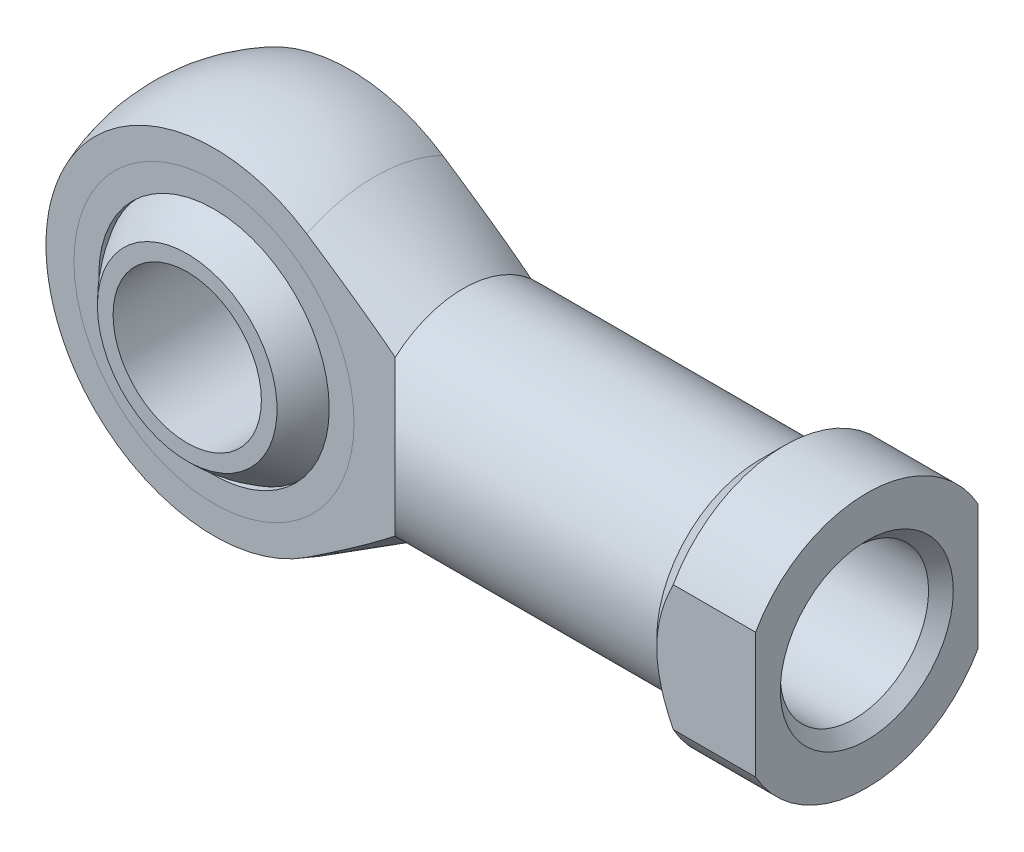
ISO-10303-21;
HEADER;
FILE_DESCRIPTION(('STEP AP214'),'2;1');
FILE_NAME('part.step','',(''),(''),'','','');
FILE_SCHEMA(('AUTOMOTIVE_DESIGN { 1 0 10303 214 1 1 1 1 }'));
ENDSEC;
DATA;
#1=APPLICATION_CONTEXT('core data for automotive mechanical design processes');
#2=APPLICATION_PROTOCOL_DEFINITION('international standard','automotive_design',2000,#1);
#3=PRODUCT_CONTEXT('',#1,'mechanical');
#4=PRODUCT('Part','Part','',(#3));
#5=PRODUCT_RELATED_PRODUCT_CATEGORY('part','',(#4));
#6=PRODUCT_DEFINITION_FORMATION('','',#4);
#7=PRODUCT_DEFINITION_CONTEXT('part definition',#1,'design');
#8=PRODUCT_DEFINITION('design','',#6,#7);
#9=PRODUCT_DEFINITION_SHAPE('','',#8);
#10=(LENGTH_UNIT() NAMED_UNIT(*) SI_UNIT(.MILLI.,.METRE.));
#11=(NAMED_UNIT(*) PLANE_ANGLE_UNIT() SI_UNIT($,.RADIAN.));
#12=(NAMED_UNIT(*) SI_UNIT($,.STERADIAN.) SOLID_ANGLE_UNIT());
#13=UNCERTAINTY_MEASURE_WITH_UNIT(LENGTH_MEASURE(1.E-05),#10,'distance_accuracy_value','');
#14=(GEOMETRIC_REPRESENTATION_CONTEXT(3) GLOBAL_UNCERTAINTY_ASSIGNED_CONTEXT((#13)) GLOBAL_UNIT_ASSIGNED_CONTEXT((#10,
#11,#12)) REPRESENTATION_CONTEXT('',''));
#15=CARTESIAN_POINT('',(0.,0.,0.));
#16=DIRECTION('',(0.,0.,1.));
#17=DIRECTION('',(1.,0.,0.));
#18=AXIS2_PLACEMENT_3D('',#15,#16,#17);
#19=CARTESIAN_POINT('',(0.,0.,0.));
#20=DIRECTION('',(0.,1.,0.));
#21=DIRECTION('',(1.,0.,0.));
#22=AXIS2_PLACEMENT_3D('',#19,#20,#21);
#23=SPHERICAL_SURFACE('',#22,15.85);
#24=CARTESIAN_POINT('',(0.,0.,0.));
#25=DIRECTION('',(0.,0.,-1.));
#26=DIRECTION('',(-1.,0.,0.));
#27=AXIS2_PLACEMENT_3D('',#24,#25,#26);
#28=SPHERICAL_SURFACE('',#27,15.85);
#29=CARTESIAN_POINT('',(0.,0.,11.5));
#30=DIRECTION('',(0.,0.,-1.));
#31=DIRECTION('',(-1.,0.,0.));
#32=AXIS2_PLACEMENT_3D('',#29,#30,#31);
#33=CIRCLE('',#32,10.9074515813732);
#34=CARTESIAN_POINT('',(-10.9074515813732,0.,11.5));
#35=VERTEX_POINT('',#34);
#36=EDGE_CURVE('P0_E26',#35,#35,#33,.F.);
#37=ORIENTED_EDGE('',*,*,#36,.F.);
#38=EDGE_LOOP('',(#37));
#39=FACE_BOUND('',#38,.T.);
#40=CARTESIAN_POINT('',(0.,0.,-11.5));
#41=DIRECTION('',(0.,0.,1.));
#42=DIRECTION('',(1.,0.,0.));
#43=AXIS2_PLACEMENT_3D('',#40,#41,#42);
#44=CIRCLE('',#43,10.9074515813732);
#45=CARTESIAN_POINT('',(10.9074515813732,0.,-11.5));
#46=VERTEX_POINT('',#45);
#47=EDGE_CURVE('P0_E10',#46,#46,#44,.F.);
#48=ORIENTED_EDGE('',*,*,#47,.F.);
#49=EDGE_LOOP('',(#48));
#50=FACE_BOUND('',#49,.T.);
#51=ADVANCED_FACE('P0_F14',(#39,#50),#28,.T.);
#52=CARTESIAN_POINT('',(0.,0.,-15.85));
#53=DIRECTION('',(0.,0.,1.));
#54=DIRECTION('',(1.,0.,0.));
#55=AXIS2_PLACEMENT_3D('',#52,#53,#54);
#56=CYLINDRICAL_SURFACE('',#55,9.);
#57=CARTESIAN_POINT('',(0.,0.,11.5));
#58=DIRECTION('',(0.,0.,-1.));
#59=DIRECTION('',(-1.,0.,0.));
#60=AXIS2_PLACEMENT_3D('',#57,#58,#59);
#61=CIRCLE('',#60,9.);
#62=CARTESIAN_POINT('',(-9.,0.,11.5));
#63=VERTEX_POINT('',#62);
#64=EDGE_CURVE('P0_E17',#63,#63,#61,.F.);
#65=ORIENTED_EDGE('',*,*,#64,.T.);
#66=EDGE_LOOP('',(#65));
#67=FACE_BOUND('',#66,.T.);
#68=CARTESIAN_POINT('',(0.,0.,-11.5));
#69=DIRECTION('',(0.,0.,1.));
#70=DIRECTION('',(1.,0.,0.));
#71=AXIS2_PLACEMENT_3D('',#68,#69,#70);
#72=CIRCLE('',#71,9.);
#73=CARTESIAN_POINT('',(9.,0.,-11.5));
#74=VERTEX_POINT('',#73);
#75=EDGE_CURVE('P0_E21',#74,#74,#72,.F.);
#76=ORIENTED_EDGE('',*,*,#75,.T.);
#77=EDGE_LOOP('',(#76));
#78=FACE_BOUND('',#77,.T.);
#79=ADVANCED_FACE('P0_F34',(#67,#78),#56,.F.);
#80=CARTESIAN_POINT('',(-15.85,-15.85,-11.5));
#81=DIRECTION('',(0.,0.,1.));
#82=DIRECTION('',(1.,0.,0.));
#83=AXIS2_PLACEMENT_3D('',#80,#81,#82);
#84=PLANE('',#83);
#85=ORIENTED_EDGE('',*,*,#47,.T.);
#86=EDGE_LOOP('',(#85));
#87=FACE_BOUND('',#86,.T.);
#88=ORIENTED_EDGE('',*,*,#75,.F.);
#89=EDGE_LOOP('',(#88));
#90=FACE_BOUND('',#89,.T.);
#91=ADVANCED_FACE('P0_F39',(#87,#90),#84,.F.);
#92=CARTESIAN_POINT('',(-15.85,-15.85,11.5));
#93=DIRECTION('',(0.,0.,-1.));
#94=DIRECTION('',(-1.,0.,0.));
#95=AXIS2_PLACEMENT_3D('',#92,#93,#94);
#96=PLANE('',#95);
#97=ORIENTED_EDGE('',*,*,#36,.T.);
#98=EDGE_LOOP('',(#97));
#99=FACE_BOUND('',#98,.T.);
#100=ORIENTED_EDGE('',*,*,#64,.F.);
#101=EDGE_LOOP('',(#100));
#102=FACE_BOUND('',#101,.T.);
#103=ADVANCED_FACE('P0_F37',(#99,#102),#96,.F.);
#104=CLOSED_SHELL('',(#51,#79,#91,#103));
#105=MANIFOLD_SOLID_BREP('P0_B1',#104);
#106=CARTESIAN_POINT('',(0.,0.,8.25));
#107=DIRECTION('',(0.,0.,1.));
#108=DIRECTION('',(1.,0.,0.));
#109=AXIS2_PLACEMENT_3D('',#106,#107,#108);
#110=PLANE('',#109);
#111=CARTESIAN_POINT('',(0.,0.,8.25));
#112=DIRECTION('',(0.,0.,1.));
#113=DIRECTION('',(1.,0.,0.));
#114=AXIS2_PLACEMENT_3D('',#111,#112,#113);
#115=CIRCLE('',#114,17.);
#116=CARTESIAN_POINT('',(17.,0.,8.25));
#117=VERTEX_POINT('',#116);
#118=EDGE_CURVE('P1_E10',#117,#117,#115,.T.);
#119=ORIENTED_EDGE('',*,*,#118,.T.);
#120=EDGE_LOOP('',(#119));
#121=FACE_BOUND('',#120,.T.);
#122=CARTESIAN_POINT('',(0.,0.,8.25));
#123=DIRECTION('',(0.,0.,1.));
#124=DIRECTION('',(1.,0.,0.));
#125=AXIS2_PLACEMENT_3D('',#122,#123,#124);
#126=CIRCLE('',#125,13.99);
#127=CARTESIAN_POINT('',(13.99,0.,8.25));
#128=VERTEX_POINT('',#127);
#129=EDGE_CURVE('P1_E25',#128,#128,#126,.T.);
#130=ORIENTED_EDGE('',*,*,#129,.F.);
#131=EDGE_LOOP('',(#130));
#132=FACE_BOUND('',#131,.T.);
#133=ADVANCED_FACE('P1_F14',(#121,#132),#110,.T.);
#134=CARTESIAN_POINT('',(0.,0.,7.45));
#135=DIRECTION('',(0.,0.,1.));
#136=DIRECTION('',(1.,0.,0.));
#137=AXIS2_PLACEMENT_3D('',#134,#135,#136);
#138=PLANE('',#137);
#139=CARTESIAN_POINT('',(0.,0.,7.45));
#140=DIRECTION('',(0.,0.,1.));
#141=DIRECTION('',(1.,0.,0.));
#142=AXIS2_PLACEMENT_3D('',#139,#140,#141);
#143=CIRCLE('',#142,17.);
#144=CARTESIAN_POINT('',(17.,0.,7.45));
#145=VERTEX_POINT('',#144);
#146=EDGE_CURVE('P1_E18',#145,#145,#143,.T.);
#147=ORIENTED_EDGE('',*,*,#146,.F.);
#148=EDGE_LOOP('',(#147));
#149=FACE_BOUND('',#148,.T.);
#150=CARTESIAN_POINT('',(0.,0.,7.45));
#151=DIRECTION('',(0.,0.,1.));
#152=DIRECTION('',(1.,0.,0.));
#153=AXIS2_PLACEMENT_3D('',#150,#151,#152);
#154=CIRCLE('',#153,13.99);
#155=CARTESIAN_POINT('',(13.99,0.,7.45));
#156=VERTEX_POINT('',#155);
#157=EDGE_CURVE('P1_E27',#156,#156,#154,.T.);
#158=ORIENTED_EDGE('',*,*,#157,.T.);
#159=EDGE_LOOP('',(#158));
#160=FACE_BOUND('',#159,.T.);
#161=ADVANCED_FACE('P1_F37',(#149,#160),#138,.F.);
#162=CARTESIAN_POINT('',(0.,0.,8.25));
#163=DIRECTION('',(0.,0.,-1.));
#164=DIRECTION('',(-1.,0.,0.));
#165=AXIS2_PLACEMENT_3D('',#162,#163,#164);
#166=CYLINDRICAL_SURFACE('',#165,17.);
#167=ORIENTED_EDGE('',*,*,#118,.F.);
#168=EDGE_LOOP('',(#167));
#169=FACE_BOUND('',#168,.T.);
#170=ORIENTED_EDGE('',*,*,#146,.T.);
#171=EDGE_LOOP('',(#170));
#172=FACE_BOUND('',#171,.T.);
#173=ADVANCED_FACE('P1_F16',(#169,#172),#166,.T.);
#174=CARTESIAN_POINT('',(0.,0.,8.25));
#175=DIRECTION('',(0.,0.,-1.));
#176=DIRECTION('',(-1.,0.,0.));
#177=AXIS2_PLACEMENT_3D('',#174,#175,#176);
#178=CYLINDRICAL_SURFACE('',#177,13.99);
#179=ORIENTED_EDGE('',*,*,#129,.T.);
#180=EDGE_LOOP('',(#179));
#181=FACE_BOUND('',#180,.T.);
#182=ORIENTED_EDGE('',*,*,#157,.F.);
#183=EDGE_LOOP('',(#182));
#184=FACE_BOUND('',#183,.T.);
#185=ADVANCED_FACE('P1_F33',(#181,#184),#178,.F.);
#186=CLOSED_SHELL('',(#133,#161,#173,#185));
#187=MANIFOLD_SOLID_BREP('P1_B1',#186);
#188=CARTESIAN_POINT('',(0.,0.,-7.45));
#189=DIRECTION('',(0.,0.,1.));
#190=DIRECTION('',(1.,0.,0.));
#191=AXIS2_PLACEMENT_3D('',#188,#189,#190);
#192=PLANE('',#191);
#193=CARTESIAN_POINT('',(0.,0.,-7.45));
#194=DIRECTION('',(0.,0.,1.));
#195=DIRECTION('',(1.,0.,0.));
#196=AXIS2_PLACEMENT_3D('',#193,#194,#195);
#197=CIRCLE('',#196,17.);
#198=CARTESIAN_POINT('',(17.,0.,-7.45));
#199=VERTEX_POINT('',#198);
#200=EDGE_CURVE('P2_E10',#199,#199,#197,.T.);
#201=ORIENTED_EDGE('',*,*,#200,.T.);
#202=EDGE_LOOP('',(#201));
#203=FACE_BOUND('',#202,.T.);
#204=CARTESIAN_POINT('',(0.,0.,-7.45));
#205=DIRECTION('',(0.,0.,1.));
#206=DIRECTION('',(1.,0.,0.));
#207=AXIS2_PLACEMENT_3D('',#204,#205,#206);
#208=CIRCLE('',#207,13.99);
#209=CARTESIAN_POINT('',(13.99,0.,-7.45));
#210=VERTEX_POINT('',#209);
#211=EDGE_CURVE('P2_E25',#210,#210,#208,.T.);
#212=ORIENTED_EDGE('',*,*,#211,.F.);
#213=EDGE_LOOP('',(#212));
#214=FACE_BOUND('',#213,.T.);
#215=ADVANCED_FACE('P2_F14',(#203,#214),#192,.T.);
#216=CARTESIAN_POINT('',(0.,0.,-8.25));
#217=DIRECTION('',(0.,0.,1.));
#218=DIRECTION('',(1.,0.,0.));
#219=AXIS2_PLACEMENT_3D('',#216,#217,#218);
#220=PLANE('',#219);
#221=CARTESIAN_POINT('',(0.,0.,-8.25));
#222=DIRECTION('',(0.,0.,1.));
#223=DIRECTION('',(1.,0.,0.));
#224=AXIS2_PLACEMENT_3D('',#221,#222,#223);
#225=CIRCLE('',#224,17.);
#226=CARTESIAN_POINT('',(17.,0.,-8.25));
#227=VERTEX_POINT('',#226);
#228=EDGE_CURVE('P2_E18',#227,#227,#225,.T.);
#229=ORIENTED_EDGE('',*,*,#228,.F.);
#230=EDGE_LOOP('',(#229));
#231=FACE_BOUND('',#230,.T.);
#232=CARTESIAN_POINT('',(0.,0.,-8.25));
#233=DIRECTION('',(0.,0.,1.));
#234=DIRECTION('',(1.,0.,0.));
#235=AXIS2_PLACEMENT_3D('',#232,#233,#234);
#236=CIRCLE('',#235,13.99);
#237=CARTESIAN_POINT('',(13.99,0.,-8.25));
#238=VERTEX_POINT('',#237);
#239=EDGE_CURVE('P2_E27',#238,#238,#236,.T.);
#240=ORIENTED_EDGE('',*,*,#239,.T.);
#241=EDGE_LOOP('',(#240));
#242=FACE_BOUND('',#241,.T.);
#243=ADVANCED_FACE('P2_F37',(#231,#242),#220,.F.);
#244=CARTESIAN_POINT('',(0.,0.,-7.45));
#245=DIRECTION('',(0.,0.,-1.));
#246=DIRECTION('',(-1.,0.,0.));
#247=AXIS2_PLACEMENT_3D('',#244,#245,#246);
#248=CYLINDRICAL_SURFACE('',#247,17.);
#249=ORIENTED_EDGE('',*,*,#200,.F.);
#250=EDGE_LOOP('',(#249));
#251=FACE_BOUND('',#250,.T.);
#252=ORIENTED_EDGE('',*,*,#228,.T.);
#253=EDGE_LOOP('',(#252));
#254=FACE_BOUND('',#253,.T.);
#255=ADVANCED_FACE('P2_F16',(#251,#254),#248,.T.);
#256=CARTESIAN_POINT('',(0.,0.,-7.45));
#257=DIRECTION('',(0.,0.,-1.));
#258=DIRECTION('',(-1.,0.,0.));
#259=AXIS2_PLACEMENT_3D('',#256,#257,#258);
#260=CYLINDRICAL_SURFACE('',#259,13.99);
#261=ORIENTED_EDGE('',*,*,#211,.T.);
#262=EDGE_LOOP('',(#261));
#263=FACE_BOUND('',#262,.T.);
#264=ORIENTED_EDGE('',*,*,#239,.F.);
#265=EDGE_LOOP('',(#264));
#266=FACE_BOUND('',#265,.T.);
#267=ADVANCED_FACE('P2_F33',(#263,#266),#260,.F.);
#268=CLOSED_SHELL('',(#215,#243,#255,#267));
#269=MANIFOLD_SOLID_BREP('P2_B1',#268);
#270=CARTESIAN_POINT('',(0.,0.,0.));
#271=DIRECTION('',(0.,1.,0.));
#272=DIRECTION('',(1.,0.,0.));
#273=AXIS2_PLACEMENT_3D('',#270,#271,#272);
#274=SPHERICAL_SURFACE('',#273,15.85);
#275=CARTESIAN_POINT('',(0.,0.,0.));
#276=DIRECTION('',(0.,0.,1.));
#277=DIRECTION('',(1.,0.,0.));
#278=AXIS2_PLACEMENT_3D('',#275,#276,#277);
#279=SPHERICAL_SURFACE('',#278,15.85);
#280=CARTESIAN_POINT('',(0.,0.,7.45));
#281=DIRECTION('',(0.,0.,1.));
#282=DIRECTION('',(1.,0.,0.));
#283=AXIS2_PLACEMENT_3D('',#280,#281,#282);
#284=CIRCLE('',#283,13.9899964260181);
#285=CARTESIAN_POINT('',(13.9899964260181,0.,7.45));
#286=VERTEX_POINT('',#285);
#287=EDGE_CURVE('P3_E73',#286,#286,#284,.F.);
#288=ORIENTED_EDGE('',*,*,#287,.F.);
#289=EDGE_LOOP('',(#288));
#290=FACE_BOUND('',#289,.T.);
#291=CARTESIAN_POINT('',(0.,0.,-7.45));
#292=DIRECTION('',(0.,0.,-1.));
#293=DIRECTION('',(-1.,0.,0.));
#294=AXIS2_PLACEMENT_3D('',#291,#292,#293);
#295=CIRCLE('',#294,13.9899964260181);
#296=CARTESIAN_POINT('',(-13.9899964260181,0.,-7.45));
#297=VERTEX_POINT('',#296);
#298=EDGE_CURVE('P3_E20',#297,#297,#295,.F.);
#299=ORIENTED_EDGE('',*,*,#298,.F.);
#300=EDGE_LOOP('',(#299));
#301=FACE_BOUND('',#300,.T.);
#302=ADVANCED_FACE('P3_F16',(#290,#301),#279,.F.);
#303=CARTESIAN_POINT('',(-22.,-22.,-8.25));
#304=DIRECTION('',(0.,0.,1.));
#305=DIRECTION('',(1.,0.,0.));
#306=AXIS2_PLACEMENT_3D('',#303,#304,#305);
#307=PLANE('',#306);
#308=CARTESIAN_POINT('',(0.,0.,-8.25));
#309=DIRECTION('',(0.,0.,1.));
#310=DIRECTION('',(1.,0.,0.));
#311=AXIS2_PLACEMENT_3D('',#308,#309,#310);
#312=CIRCLE('',#311,20.3945458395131);
#313=CARTESIAN_POINT('',(11.2620070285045,17.0030790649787,-8.25));
#314=VERTEX_POINT('',#313);
#315=CARTESIAN_POINT('',(11.2620070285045,-17.0030790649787,-8.25));
#316=VERTEX_POINT('',#315);
#317=EDGE_CURVE('P3_E11',#314,#316,#312,.T.);
#318=ORIENTED_EDGE('',*,*,#317,.F.);
#319=CARTESIAN_POINT('',(-108.928202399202,-90.1445747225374,-8.25));
#320=CARTESIAN_POINT('',(-104.642698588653,-87.580087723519,-8.25));
#321=CARTESIAN_POINT('',(-100.357558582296,-85.0149922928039,-8.25));
#322=CARTESIAN_POINT('',(-91.7883267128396,-79.883033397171,-8.25));
#323=CARTESIAN_POINT('',(-87.5042348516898,-77.3161699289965,-8.25));
#324=CARTESIAN_POINT('',(-78.9371413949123,-72.1799568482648,-8.25));
#325=CARTESIAN_POINT('',(-74.6541398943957,-69.6106070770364,-8.25));
#326=CARTESIAN_POINT('',(-66.0900690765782,-64.4687042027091,-8.25));
#327=CARTESIAN_POINT('',(-61.8089997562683,-61.8961511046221,-8.25));
#328=CARTESIAN_POINT('',(-53.2581939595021,-56.7516263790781,-8.25));
#329=CARTESIAN_POINT('',(-48.9884519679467,-54.1796639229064,-8.25));
#330=CARTESIAN_POINT('',(-42.5869715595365,-50.3165050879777,-8.25));
#331=CARTESIAN_POINT('',(-40.4536615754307,-49.027913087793,-8.25));
#332=CARTESIAN_POINT('',(-36.1883781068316,-46.4485198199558,-8.25));
#333=CARTESIAN_POINT('',(-34.0564046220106,-45.1577185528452,-8.25));
#334=CARTESIAN_POINT('',(-29.7942438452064,-42.5733297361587,-8.25));
#335=CARTESIAN_POINT('',(-27.6640564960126,-41.2797422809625,-8.25));
#336=CARTESIAN_POINT('',(-23.4059461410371,-38.6888470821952,-8.25));
#337=CARTESIAN_POINT('',(-21.2780231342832,-37.3915393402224,-8.25));
#338=CARTESIAN_POINT('',(-17.0252539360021,-34.7919224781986,-8.25));
#339=CARTESIAN_POINT('',(-14.9004077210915,-33.4896133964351,-8.25));
#340=CARTESIAN_POINT('',(-11.7163900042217,-31.5308687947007,-8.25));
#341=CARTESIAN_POINT('',(-10.6555937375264,-30.8770744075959,-8.25));
#342=CARTESIAN_POINT('',(-8.53531712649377,-29.5673556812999,-8.25));
#343=CARTESIAN_POINT('',(-7.47583678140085,-28.9114313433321,-8.25));
#344=CARTESIAN_POINT('',(-5.79525879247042,-27.8681385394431,-8.25));
#345=CARTESIAN_POINT('',(-5.17363441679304,-27.4816185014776,-8.25));
#346=CARTESIAN_POINT('',(-3.93101618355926,-26.7075654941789,-8.25));
#347=CARTESIAN_POINT('',(-3.31002232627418,-26.3200325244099,-8.25));
#348=CARTESIAN_POINT('',(-2.06874915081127,-25.543816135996,-8.25));
#349=CARTESIAN_POINT('',(-1.4484698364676,-25.1551327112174,-8.25));
#350=CARTESIAN_POINT('',(-0.208737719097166,-24.3764507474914,-8.25));
#351=CARTESIAN_POINT('',(0.410715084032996,-23.9864522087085,-8.25));
#352=CARTESIAN_POINT('',(2.26848365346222,-22.8136866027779,-8.25));
#353=CARTESIAN_POINT('',(3.50538091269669,-22.0286670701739,-8.25));
#354=CARTESIAN_POINT('',(5.35682970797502,-20.8450529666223,-8.25));
#355=CARTESIAN_POINT('',(5.97332755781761,-20.4495022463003,-8.25));
#356=CARTESIAN_POINT('',(7.20477347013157,-19.6559962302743,-8.25));
#357=CARTESIAN_POINT('',(7.81972153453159,-19.2580409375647,-8.25));
#358=CARTESIAN_POINT('',(9.19662662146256,-18.3624558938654,-8.25));
#359=CARTESIAN_POINT('',(9.95808023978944,-17.8640513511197,-8.25));
#360=CARTESIAN_POINT('',(11.4773538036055,-16.861702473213,-8.25));
#361=CARTESIAN_POINT('',(12.2351736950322,-16.357758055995,-8.25));
#362=CARTESIAN_POINT('',(13.7450641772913,-15.3434194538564,-8.25));
#363=CARTESIAN_POINT('',(14.4971409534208,-14.833034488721,-8.25));
#364=CARTESIAN_POINT('',(15.9948845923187,-13.8029758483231,-8.25));
#365=CARTESIAN_POINT('',(16.740551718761,-13.2833025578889,-8.25));
#366=CARTESIAN_POINT('',(17.9469175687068,-12.4271758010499,-8.25));
#367=CARTESIAN_POINT('',(18.4103342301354,-12.0945558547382,-8.25));
#368=CARTESIAN_POINT('',(19.3326781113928,-11.4231442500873,-8.25));
#369=CARTESIAN_POINT('',(19.7916053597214,-11.0843526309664,-8.25));
#370=CARTESIAN_POINT('',(20.7054002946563,-10.3977521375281,-8.25));
#371=CARTESIAN_POINT('',(21.1602461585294,-10.049914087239,-8.25));
#372=CARTESIAN_POINT('',(21.8365963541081,-9.52073031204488,-8.25));
#373=CARTESIAN_POINT('',(22.0610279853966,-9.34312413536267,-8.25));
#374=CARTESIAN_POINT('',(22.5076388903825,-8.98502763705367,-8.25));
#375=CARTESIAN_POINT('',(22.7298178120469,-8.80453687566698,-8.25));
#376=CARTESIAN_POINT('',(23.1734040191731,-8.43869169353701,-8.25));
#377=CARTESIAN_POINT('',(23.3947876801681,-8.25330858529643,-8.25));
#378=CARTESIAN_POINT('',(23.8342700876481,-7.87869059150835,-8.25));
#379=CARTESIAN_POINT('',(24.0523689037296,-7.68945578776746,-8.25));
#380=CARTESIAN_POINT('',(24.4845509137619,-7.3065376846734,-8.25));
#381=CARTESIAN_POINT('',(24.6986349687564,-7.11285535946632,-8.25));
#382=CARTESIAN_POINT('',(25.1219202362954,-6.72024101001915,-8.25));
#383=CARTESIAN_POINT('',(25.3311218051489,-6.5213093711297,-8.25));
#384=CARTESIAN_POINT('',(25.7425297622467,-6.11814064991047,-8.25));
#385=CARTESIAN_POINT('',(25.9447633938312,-5.91393147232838,-8.25));
#386=CARTESIAN_POINT('',(26.3416494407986,-5.49816302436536,-8.25));
#387=CARTESIAN_POINT('',(26.5363004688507,-5.28660242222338,-8.25));
#388=CARTESIAN_POINT('',(26.9153805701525,-4.8551997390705,-8.25));
#389=CARTESIAN_POINT('',(27.099828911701,-4.63537468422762,-8.25));
#390=CARTESIAN_POINT('',(27.4557419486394,-4.18551467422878,-8.25));
#391=CARTESIAN_POINT('',(27.6272136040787,-3.95548529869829,-8.25));
#392=CARTESIAN_POINT('',(27.8966574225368,-3.56480332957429,-8.25));
#393=CARTESIAN_POINT('',(27.9995873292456,-3.40757538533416,-8.25));
#394=CARTESIAN_POINT('',(28.196357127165,-3.08745188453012,-8.25));
#395=CARTESIAN_POINT('',(28.2901956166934,-2.92455545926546,-8.25));
#396=CARTESIAN_POINT('',(28.4666033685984,-2.59306587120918,-8.25));
#397=CARTESIAN_POINT('',(28.5491906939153,-2.42448239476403,-8.25));
#398=CARTESIAN_POINT('',(28.7008800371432,-2.08133288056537,-8.25));
#399=CARTESIAN_POINT('',(28.7699860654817,-1.90676864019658,-8.25));
#400=CARTESIAN_POINT('',(28.878916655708,-1.59038038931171,-8.25));
#401=CARTESIAN_POINT('',(28.9218418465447,-1.44962571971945,-8.25));
#402=CARTESIAN_POINT('',(28.9965510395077,-1.16517828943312,-8.25));
#403=CARTESIAN_POINT('',(29.0283365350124,-1.02148592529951,-8.25));
#404=CARTESIAN_POINT('',(29.0796541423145,-0.732081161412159,-8.25));
#405=CARTESIAN_POINT('',(29.099200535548,-0.586371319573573,-8.25));
#406=CARTESIAN_POINT('',(29.1253551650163,-0.293777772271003,-8.25));
#407=CARTESIAN_POINT('',(29.1319625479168,-0.146893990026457,-8.25));
#408=CARTESIAN_POINT('',(29.1319578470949,0.165235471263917,-8.25));
#409=CARTESIAN_POINT('',(29.1235921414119,0.330483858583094,-8.25));
#410=CARTESIAN_POINT('',(29.0905518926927,0.659333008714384,-8.25));
#411=CARTESIAN_POINT('',(29.0658752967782,0.822933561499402,-8.25));
#412=CARTESIAN_POINT('',(29.0013292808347,1.14738717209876,-8.25));
#413=CARTESIAN_POINT('',(28.961432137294,1.30823465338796,-8.25));
#414=CARTESIAN_POINT('',(28.8680988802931,1.62592269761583,-8.25));
#415=CARTESIAN_POINT('',(28.8146607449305,1.78276265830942,-8.25));
#416=CARTESIAN_POINT('',(28.6703731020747,2.15887302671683,-8.25));
#417=CARTESIAN_POINT('',(28.5733434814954,2.37577047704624,-8.25));
#418=CARTESIAN_POINT('',(28.3602883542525,2.79999544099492,-8.25));
#419=CARTESIAN_POINT('',(28.2442509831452,3.00731687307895,-8.25));
#420=CARTESIAN_POINT('',(27.997046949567,3.41355712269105,-8.25));
#421=CARTESIAN_POINT('',(27.8658336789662,3.61244734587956,-8.25));
#422=CARTESIAN_POINT('',(27.6604030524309,3.90459474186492,-8.25));
#423=CARTESIAN_POINT('',(27.5904992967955,4.00093552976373,-8.25));
#424=CARTESIAN_POINT('',(27.4481288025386,4.19170690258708,-8.25));
#425=CARTESIAN_POINT('',(27.3756620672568,4.28613749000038,-8.25));
#426=CARTESIAN_POINT('',(27.1773135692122,4.53821951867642,-8.25));
#427=CARTESIAN_POINT('',(27.0493084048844,4.69420172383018,-8.25));
#428=CARTESIAN_POINT('',(26.7879393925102,5.00162263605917,-8.25));
#429=CARTESIAN_POINT('',(26.6545747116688,5.15306063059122,-8.25));
#430=CARTESIAN_POINT('',(26.2477155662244,5.60151216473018,-8.25));
#431=CARTESIAN_POINT('',(25.9675817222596,5.89250705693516,-8.25));
#432=CARTESIAN_POINT('',(25.3942171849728,6.46254446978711,-8.25));
#433=CARTESIAN_POINT('',(25.1009565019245,6.7415564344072,-8.25));
#434=CARTESIAN_POINT('',(24.5053206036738,7.28946563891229,-8.25));
#435=CARTESIAN_POINT('',(24.2029479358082,7.55836565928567,-8.25));
#436=CARTESIAN_POINT('',(23.5893732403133,8.08973707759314,-8.25));
#437=CARTESIAN_POINT('',(23.2781283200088,8.35215871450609,-8.25));
#438=CARTESIAN_POINT('',(22.6501637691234,8.87038642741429,-8.25));
#439=CARTESIAN_POINT('',(22.3334438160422,9.12619211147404,-8.25));
#440=CARTESIAN_POINT('',(21.6961709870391,9.63195078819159,-8.25));
#441=CARTESIAN_POINT('',(21.3756247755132,9.88191219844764,-8.25));
#442=CARTESIAN_POINT('',(20.7310591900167,10.3772868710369,-8.25));
#443=CARTESIAN_POINT('',(20.4070399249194,10.6227002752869,-8.25));
#444=CARTESIAN_POINT('',(19.7611011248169,11.1059922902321,-8.25));
#445=CARTESIAN_POINT('',(19.4392247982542,11.3439287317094,-8.25));
#446=CARTESIAN_POINT('',(18.7931537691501,11.8166351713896,-8.25));
#447=CARTESIAN_POINT('',(18.4689590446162,12.0514051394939,-8.25));
#448=CARTESIAN_POINT('',(17.4934297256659,12.7516704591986,-8.25));
#449=CARTESIAN_POINT('',(16.8391769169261,13.2131012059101,-8.25));
#450=CARTESIAN_POINT('',(15.5248766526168,14.1278607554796,-8.25));
#451=CARTESIAN_POINT('',(14.8648281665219,14.5811880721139,-8.25));
#452=CARTESIAN_POINT('',(13.5404036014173,15.4814839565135,-8.25));
#453=CARTESIAN_POINT('',(12.8760274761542,15.9284524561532,-8.25));
#454=CARTESIAN_POINT('',(11.5431860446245,16.8178337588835,-8.25));
#455=CARTESIAN_POINT('',(10.8747170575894,17.2602410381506,-8.25));
#456=CARTESIAN_POINT('',(9.53509812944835,18.140981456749,-8.25));
#457=CARTESIAN_POINT('',(8.86394817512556,18.5793145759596,-8.25));
#458=CARTESIAN_POINT('',(7.5195580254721,19.4525956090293,-8.25));
#459=CARTESIAN_POINT('',(6.84631807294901,19.8875438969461,-8.25));
#460=CARTESIAN_POINT('',(5.49805623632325,20.7546698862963,-8.25));
#461=CARTESIAN_POINT('',(4.82303434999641,21.1868475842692,-8.25));
#462=CARTESIAN_POINT('',(2.80370776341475,22.474847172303,-8.25));
#463=CARTESIAN_POINT('',(1.45722836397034,23.3272594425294,-8.25));
#464=CARTESIAN_POINT('',(-1.23991821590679,25.0255014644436,-8.25));
#465=CARTESIAN_POINT('',(-2.59058550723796,25.8713310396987,-8.25));
#466=CARTESIAN_POINT('',(-5.29428724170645,27.5575689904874,-8.25));
#467=CARTESIAN_POINT('',(-6.64732001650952,28.3979800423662,-8.25));
#468=CARTESIAN_POINT('',(-9.35573832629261,30.0749730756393,-8.25));
#469=CARTESIAN_POINT('',(-10.7111238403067,30.9115550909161,-8.25));
#470=CARTESIAN_POINT('',(-14.0649091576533,32.9764960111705,-8.25));
#471=CARTESIAN_POINT('',(-16.0643864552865,34.203104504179,-8.25));
#472=CARTESIAN_POINT('',(-20.0662141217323,36.6516272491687,-8.25));
#473=CARTESIAN_POINT('',(-22.0685644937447,37.8735414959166,-8.25));
#474=CARTESIAN_POINT('',(-26.0754238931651,40.3138529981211,-8.25));
#475=CARTESIAN_POINT('',(-28.0799329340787,41.5322502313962,-8.25));
#476=CARTESIAN_POINT('',(-32.0905946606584,43.9663369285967,-8.25));
#477=CARTESIAN_POINT('',(-34.096747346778,45.1820263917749,-8.25));
#478=CARTESIAN_POINT('',(-38.1108358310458,47.6115793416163,-8.25));
#479=CARTESIAN_POINT('',(-40.1187719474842,48.8254423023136,-8.25));
#480=CARTESIAN_POINT('',(-44.1356735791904,51.2514639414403,-8.25));
#481=CARTESIAN_POINT('',(-46.1446390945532,52.4636226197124,-8.25));
#482=CARTESIAN_POINT('',(-52.1727643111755,56.0980328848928,-8.25));
#483=CARTESIAN_POINT('',(-56.1931649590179,58.5182261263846,-8.25));
#484=CARTESIAN_POINT('',(-64.271558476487,63.3761211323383,-8.25));
#485=CARTESIAN_POINT('',(-68.3295712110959,65.8137898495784,-8.25));
#486=CARTESIAN_POINT('',(-76.4472422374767,70.6863945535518,-8.25));
#487=CARTESIAN_POINT('',(-80.5069005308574,73.1213305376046,-8.25));
#488=CARTESIAN_POINT('',(-88.6263135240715,77.9885238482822,-8.25));
#489=CARTESIAN_POINT('',(-92.6860678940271,80.4207817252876,-8.25));
#490=CARTESIAN_POINT('',(-100.80650542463,85.2837356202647,-8.25));
#491=CARTESIAN_POINT('',(-104.867188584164,87.7144316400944,-8.25));
#492=CARTESIAN_POINT('',(-108.928202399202,90.1445747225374,-8.25));
#493=B_SPLINE_CURVE_WITH_KNOTS('',3,(#319,#320,#321,#322,#323,#324,#325,#326,#327,#328,#329,
#330,#331,#332,#333,#334,#335,#336,#337,#338,#339,#340,#341,#342,#343,#344,#345,#346,#347,#348,
#349,#350,#351,#352,#353,#354,#355,#356,#357,#358,#359,#360,#361,#362,#363,#364,#365,#366,#367,
#368,#369,#370,#371,#372,#373,#374,#375,#376,#377,#378,#379,#380,#381,#382,#383,#384,#385,#386,
#387,#388,#389,#390,#391,#392,#393,#394,#395,#396,#397,#398,#399,#400,#401,#402,#403,#404,#405,
#406,#407,#408,#409,#410,#411,#412,#413,#414,#415,#416,#417,#418,#419,#420,#421,#422,#423,#424,
#425,#426,#427,#428,#429,#430,#431,#432,#433,#434,#435,#436,#437,#438,#439,#440,#441,#442,#443,
#444,#445,#446,#447,#448,#449,#450,#451,#452,#453,#454,#455,#456,#457,#458,#459,#460,#461,#462,
#463,#464,#465,#466,#467,#468,#469,#470,#471,#472,#473,#474,#475,#476,#477,#478,#479,#480,#481,
#482,#483,#484,#485,#486,#487,#488,#489,#490,#491,#492),.UNSPECIFIED.,.F.,.F.,(4,2,2,2,2,2,2,2,
2,2,2,2,2,2,2,2,2,2,2,2,2,2,2,2,2,2,2,2,2,2,2,2,2,2,2,2,2,2,2,2,2,2,2,2,2,2,2,2,2,2,2,2,2,2,2,2,
2,2,2,2,2,2,2,2,2,2,2,2,2,2,2,2,2,2,2,2,2,2,2,2,2,2,2,2,2,2,4),(0.,14.9826312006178,
29.9652900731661,44.9489781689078,59.9326428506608,74.886272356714,82.3631241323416,
89.8399740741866,97.316574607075,104.793171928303,112.269712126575,116.007974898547,
119.746235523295,121.942215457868,124.138196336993,126.334188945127,128.530181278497,
132.925096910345,135.122538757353,137.319977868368,140.050154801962,142.780372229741,
145.50704620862,148.233607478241,149.944859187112,151.656100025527,153.37379121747,
154.232388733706,155.091118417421,155.957336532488,156.823536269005,157.689548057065,
158.555496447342,159.417547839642,160.279756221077,161.140276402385,162.000331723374,
162.563856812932,163.127468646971,163.690164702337,164.252693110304,164.693758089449,
165.134763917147,165.575254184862,166.015773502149,166.511296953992,167.006882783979,
167.503375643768,167.999942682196,168.711520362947,169.423543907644,170.13781538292,
170.494871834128,170.851927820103,171.457113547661,172.062393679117,173.273554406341,
174.487639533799,175.7013883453,176.922608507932,178.143900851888,179.363309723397,
180.582680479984,181.783475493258,182.984281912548,185.385995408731,187.788144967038,
190.19032024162,192.595125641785,194.999942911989,197.404490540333,199.8090411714,
204.589859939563,209.370806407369,214.149175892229,218.927503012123,225.964701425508,
233.001907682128,240.039158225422,247.076410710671,254.11540366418,261.154397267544,
275.232341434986,289.434004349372,303.635681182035,317.833474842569,332.031251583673),.UNSPECIFIED.);
#494=CARTESIAN_POINT('',(22.,9.39081998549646,-8.25));
#495=VERTEX_POINT('',#494);
#496=EDGE_CURVE('P3_E102',#495,#314,#493,.T.);
#497=ORIENTED_EDGE('',*,*,#496,.F.);
#498=DIRECTION('',(0.,1.,0.));
#499=VECTOR('',#498,1.);
#500=CARTESIAN_POINT('',(22.,-22.,-8.25));
#501=LINE('',#500,#499);
#502=CARTESIAN_POINT('',(22.,-9.39081998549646,-8.25));
#503=VERTEX_POINT('',#502);
#504=EDGE_CURVE('P3_E64',#503,#495,#501,.T.);
#505=ORIENTED_EDGE('',*,*,#504,.F.);
#506=EDGE_CURVE('P3_E33',#316,#503,#493,.T.);
#507=ORIENTED_EDGE('',*,*,#506,.F.);
#508=EDGE_LOOP('',(#318,#497,#505,#507));
#509=FACE_BOUND('',#508,.T.);
#510=CARTESIAN_POINT('',(0.,0.,-8.25));
#511=DIRECTION('',(0.,0.,1.));
#512=DIRECTION('',(1.,0.,0.));
#513=AXIS2_PLACEMENT_3D('',#510,#511,#512);
#514=CIRCLE('',#513,17.);
#515=CARTESIAN_POINT('',(17.,0.,-8.25));
#516=VERTEX_POINT('',#515);
#517=EDGE_CURVE('P3_E95',#516,#516,#514,.T.);
#518=ORIENTED_EDGE('',*,*,#517,.T.);
#519=EDGE_LOOP('',(#518));
#520=FACE_BOUND('',#519,.T.);
#521=ADVANCED_FACE('P3_F115',(#509,#520),#307,.F.);
#522=CARTESIAN_POINT('',(22.,0.,0.));
#523=DIRECTION('',(-1.,0.,0.));
#524=DIRECTION('',(0.,0.,1.));
#525=AXIS2_PLACEMENT_3D('',#522,#523,#524);
#526=CONICAL_SURFACE('',#525,12.5,0.537406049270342);
#527=CARTESIAN_POINT('',(11.2620070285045,0.,0.));
#528=DIRECTION('',(-1.,0.,0.));
#529=DIRECTION('',(0.,0.,1.));
#530=AXIS2_PLACEMENT_3D('',#527,#528,#529);
#531=CIRCLE('',#530,18.8988676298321);
#532=CARTESIAN_POINT('',(11.2620070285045,-17.0030790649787,8.25));
#533=VERTEX_POINT('',#532);
#534=EDGE_CURVE('P3_E79',#316,#533,#531,.T.);
#535=ORIENTED_EDGE('',*,*,#534,.F.);
#536=ORIENTED_EDGE('',*,*,#506,.T.);
#537=CARTESIAN_POINT('',(22.,0.,0.));
#538=DIRECTION('',(-1.,0.,0.));
#539=DIRECTION('',(0.,0.,1.));
#540=AXIS2_PLACEMENT_3D('',#537,#538,#539);
#541=CIRCLE('',#540,12.5);
#542=CARTESIAN_POINT('',(22.,-9.39081998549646,8.25));
#543=VERTEX_POINT('',#542);
#544=EDGE_CURVE('P3_E70',#503,#543,#541,.T.);
#545=ORIENTED_EDGE('',*,*,#544,.T.);
#546=CARTESIAN_POINT('',(-108.928202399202,90.1445747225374,8.25));
#547=CARTESIAN_POINT('',(-104.642698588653,87.580087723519,8.25));
#548=CARTESIAN_POINT('',(-100.357558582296,85.0149922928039,8.25));
#549=CARTESIAN_POINT('',(-91.7883267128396,79.883033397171,8.25));
#550=CARTESIAN_POINT('',(-87.5042348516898,77.3161699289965,8.25));
#551=CARTESIAN_POINT('',(-78.9371413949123,72.1799568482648,8.25));
#552=CARTESIAN_POINT('',(-74.6541398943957,69.6106070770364,8.25));
#553=CARTESIAN_POINT('',(-66.0900690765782,64.4687042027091,8.25));
#554=CARTESIAN_POINT('',(-61.8089997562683,61.8961511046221,8.25));
#555=CARTESIAN_POINT('',(-53.2581939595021,56.7516263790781,8.25));
#556=CARTESIAN_POINT('',(-48.9884519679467,54.1796639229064,8.25));
#557=CARTESIAN_POINT('',(-42.5869715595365,50.3165050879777,8.25));
#558=CARTESIAN_POINT('',(-40.4536615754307,49.027913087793,8.25));
#559=CARTESIAN_POINT('',(-36.1883781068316,46.4485198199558,8.25));
#560=CARTESIAN_POINT('',(-34.0564046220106,45.1577185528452,8.25));
#561=CARTESIAN_POINT('',(-29.7942438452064,42.5733297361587,8.25));
#562=CARTESIAN_POINT('',(-27.6640564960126,41.2797422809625,8.25));
#563=CARTESIAN_POINT('',(-23.4059461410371,38.6888470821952,8.25));
#564=CARTESIAN_POINT('',(-21.2780231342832,37.3915393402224,8.25));
#565=CARTESIAN_POINT('',(-17.0252539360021,34.7919224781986,8.25));
#566=CARTESIAN_POINT('',(-14.9004077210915,33.4896133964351,8.25));
#567=CARTESIAN_POINT('',(-11.7163900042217,31.5308687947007,8.25));
#568=CARTESIAN_POINT('',(-10.6555937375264,30.8770744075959,8.25));
#569=CARTESIAN_POINT('',(-8.53531712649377,29.5673556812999,8.25));
#570=CARTESIAN_POINT('',(-7.47583678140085,28.9114313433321,8.25));
#571=CARTESIAN_POINT('',(-5.79525879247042,27.8681385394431,8.25));
#572=CARTESIAN_POINT('',(-5.17363441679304,27.4816185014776,8.25));
#573=CARTESIAN_POINT('',(-3.93101618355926,26.7075654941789,8.25));
#574=CARTESIAN_POINT('',(-3.31002232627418,26.3200325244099,8.25));
#575=CARTESIAN_POINT('',(-2.06874915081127,25.543816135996,8.25));
#576=CARTESIAN_POINT('',(-1.4484698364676,25.1551327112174,8.25));
#577=CARTESIAN_POINT('',(-0.208737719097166,24.3764507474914,8.25));
#578=CARTESIAN_POINT('',(0.410715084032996,23.9864522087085,8.25));
#579=CARTESIAN_POINT('',(2.26848365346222,22.8136866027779,8.25));
#580=CARTESIAN_POINT('',(3.50538091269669,22.0286670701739,8.25));
#581=CARTESIAN_POINT('',(5.35682970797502,20.8450529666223,8.25));
#582=CARTESIAN_POINT('',(5.97332755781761,20.4495022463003,8.25));
#583=CARTESIAN_POINT('',(7.20477347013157,19.6559962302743,8.25));
#584=CARTESIAN_POINT('',(7.81972153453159,19.2580409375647,8.25));
#585=CARTESIAN_POINT('',(9.19662662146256,18.3624558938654,8.25));
#586=CARTESIAN_POINT('',(9.95808023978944,17.8640513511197,8.25));
#587=CARTESIAN_POINT('',(11.4773538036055,16.861702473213,8.25));
#588=CARTESIAN_POINT('',(12.2351736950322,16.357758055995,8.25));
#589=CARTESIAN_POINT('',(13.7450641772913,15.3434194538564,8.25));
#590=CARTESIAN_POINT('',(14.4971409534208,14.833034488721,8.25));
#591=CARTESIAN_POINT('',(15.9948845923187,13.8029758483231,8.25));
#592=CARTESIAN_POINT('',(16.740551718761,13.2833025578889,8.25));
#593=CARTESIAN_POINT('',(17.9469175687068,12.4271758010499,8.25));
#594=CARTESIAN_POINT('',(18.4103342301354,12.0945558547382,8.25));
#595=CARTESIAN_POINT('',(19.3326781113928,11.4231442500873,8.25));
#596=CARTESIAN_POINT('',(19.7916053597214,11.0843526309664,8.25));
#597=CARTESIAN_POINT('',(20.7054002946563,10.3977521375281,8.25));
#598=CARTESIAN_POINT('',(21.1602461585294,10.049914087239,8.25));
#599=CARTESIAN_POINT('',(21.8365963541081,9.52073031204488,8.25));
#600=CARTESIAN_POINT('',(22.0610279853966,9.34312413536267,8.25));
#601=CARTESIAN_POINT('',(22.5076388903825,8.98502763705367,8.25));
#602=CARTESIAN_POINT('',(22.7298178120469,8.80453687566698,8.25));
#603=CARTESIAN_POINT('',(23.1734040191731,8.43869169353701,8.25));
#604=CARTESIAN_POINT('',(23.3947876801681,8.25330858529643,8.25));
#605=CARTESIAN_POINT('',(23.8342700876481,7.87869059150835,8.25));
#606=CARTESIAN_POINT('',(24.0523689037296,7.68945578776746,8.25));
#607=CARTESIAN_POINT('',(24.4845509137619,7.3065376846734,8.25));
#608=CARTESIAN_POINT('',(24.6986349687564,7.11285535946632,8.25));
#609=CARTESIAN_POINT('',(25.1219202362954,6.72024101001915,8.25));
#610=CARTESIAN_POINT('',(25.3311218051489,6.5213093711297,8.25));
#611=CARTESIAN_POINT('',(25.7425297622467,6.11814064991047,8.25));
#612=CARTESIAN_POINT('',(25.9447633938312,5.91393147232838,8.25));
#613=CARTESIAN_POINT('',(26.3416494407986,5.49816302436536,8.25));
#614=CARTESIAN_POINT('',(26.5363004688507,5.28660242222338,8.25));
#615=CARTESIAN_POINT('',(26.9153805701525,4.8551997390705,8.25));
#616=CARTESIAN_POINT('',(27.099828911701,4.63537468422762,8.25));
#617=CARTESIAN_POINT('',(27.4557419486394,4.18551467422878,8.25));
#618=CARTESIAN_POINT('',(27.6272136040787,3.95548529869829,8.25));
#619=CARTESIAN_POINT('',(27.8966574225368,3.56480332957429,8.25));
#620=CARTESIAN_POINT('',(27.9995873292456,3.40757538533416,8.25));
#621=CARTESIAN_POINT('',(28.196357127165,3.08745188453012,8.25));
#622=CARTESIAN_POINT('',(28.2901956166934,2.92455545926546,8.25));
#623=CARTESIAN_POINT('',(28.4666033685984,2.59306587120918,8.25));
#624=CARTESIAN_POINT('',(28.5491906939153,2.42448239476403,8.25));
#625=CARTESIAN_POINT('',(28.7008800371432,2.08133288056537,8.25));
#626=CARTESIAN_POINT('',(28.7699860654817,1.90676864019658,8.25));
#627=CARTESIAN_POINT('',(28.878916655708,1.59038038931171,8.25));
#628=CARTESIAN_POINT('',(28.9218418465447,1.44962571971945,8.25));
#629=CARTESIAN_POINT('',(28.9965510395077,1.16517828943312,8.25));
#630=CARTESIAN_POINT('',(29.0283365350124,1.02148592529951,8.25));
#631=CARTESIAN_POINT('',(29.0796541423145,0.732081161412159,8.25));
#632=CARTESIAN_POINT('',(29.099200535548,0.586371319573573,8.25));
#633=CARTESIAN_POINT('',(29.1253551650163,0.293777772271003,8.25));
#634=CARTESIAN_POINT('',(29.1319625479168,0.146893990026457,8.25));
#635=CARTESIAN_POINT('',(29.1319578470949,-0.165235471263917,8.25));
#636=CARTESIAN_POINT('',(29.1235921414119,-0.330483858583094,8.25));
#637=CARTESIAN_POINT('',(29.0905518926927,-0.659333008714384,8.25));
#638=CARTESIAN_POINT('',(29.0658752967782,-0.822933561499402,8.25));
#639=CARTESIAN_POINT('',(29.0013292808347,-1.14738717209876,8.25));
#640=CARTESIAN_POINT('',(28.961432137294,-1.30823465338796,8.25));
#641=CARTESIAN_POINT('',(28.8680988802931,-1.62592269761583,8.25));
#642=CARTESIAN_POINT('',(28.8146607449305,-1.78276265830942,8.25));
#643=CARTESIAN_POINT('',(28.6703731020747,-2.15887302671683,8.25));
#644=CARTESIAN_POINT('',(28.5733434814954,-2.37577047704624,8.25));
#645=CARTESIAN_POINT('',(28.3602883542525,-2.79999544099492,8.25));
#646=CARTESIAN_POINT('',(28.2442509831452,-3.00731687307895,8.25));
#647=CARTESIAN_POINT('',(27.997046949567,-3.41355712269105,8.25));
#648=CARTESIAN_POINT('',(27.8658336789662,-3.61244734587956,8.25));
#649=CARTESIAN_POINT('',(27.6604030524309,-3.90459474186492,8.25));
#650=CARTESIAN_POINT('',(27.5904992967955,-4.00093552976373,8.25));
#651=CARTESIAN_POINT('',(27.4481288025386,-4.19170690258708,8.25));
#652=CARTESIAN_POINT('',(27.3756620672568,-4.28613749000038,8.25));
#653=CARTESIAN_POINT('',(27.1773135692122,-4.53821951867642,8.25));
#654=CARTESIAN_POINT('',(27.0493084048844,-4.69420172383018,8.25));
#655=CARTESIAN_POINT('',(26.7879393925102,-5.00162263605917,8.25));
#656=CARTESIAN_POINT('',(26.6545747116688,-5.15306063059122,8.25));
#657=CARTESIAN_POINT('',(26.2477155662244,-5.60151216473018,8.25));
#658=CARTESIAN_POINT('',(25.9675817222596,-5.89250705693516,8.25));
#659=CARTESIAN_POINT('',(25.3942171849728,-6.46254446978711,8.25));
#660=CARTESIAN_POINT('',(25.1009565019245,-6.7415564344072,8.25));
#661=CARTESIAN_POINT('',(24.5053206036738,-7.28946563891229,8.25));
#662=CARTESIAN_POINT('',(24.2029479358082,-7.55836565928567,8.25));
#663=CARTESIAN_POINT('',(23.5893732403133,-8.08973707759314,8.25));
#664=CARTESIAN_POINT('',(23.2781283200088,-8.35215871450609,8.25));
#665=CARTESIAN_POINT('',(22.6501637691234,-8.87038642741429,8.25));
#666=CARTESIAN_POINT('',(22.3334438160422,-9.12619211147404,8.25));
#667=CARTESIAN_POINT('',(21.6961709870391,-9.63195078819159,8.25));
#668=CARTESIAN_POINT('',(21.3756247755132,-9.88191219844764,8.25));
#669=CARTESIAN_POINT('',(20.7310591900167,-10.3772868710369,8.25));
#670=CARTESIAN_POINT('',(20.4070399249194,-10.6227002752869,8.25));
#671=CARTESIAN_POINT('',(19.7611011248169,-11.1059922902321,8.25));
#672=CARTESIAN_POINT('',(19.4392247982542,-11.3439287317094,8.25));
#673=CARTESIAN_POINT('',(18.7931537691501,-11.8166351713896,8.25));
#674=CARTESIAN_POINT('',(18.4689590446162,-12.0514051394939,8.25));
#675=CARTESIAN_POINT('',(17.4934297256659,-12.7516704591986,8.25));
#676=CARTESIAN_POINT('',(16.8391769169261,-13.2131012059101,8.25));
#677=CARTESIAN_POINT('',(15.5248766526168,-14.1278607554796,8.25));
#678=CARTESIAN_POINT('',(14.8648281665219,-14.5811880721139,8.25));
#679=CARTESIAN_POINT('',(13.5404036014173,-15.4814839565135,8.25));
#680=CARTESIAN_POINT('',(12.8760274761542,-15.9284524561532,8.25));
#681=CARTESIAN_POINT('',(11.5431860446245,-16.8178337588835,8.25));
#682=CARTESIAN_POINT('',(10.8747170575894,-17.2602410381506,8.25));
#683=CARTESIAN_POINT('',(9.53509812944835,-18.140981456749,8.25));
#684=CARTESIAN_POINT('',(8.86394817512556,-18.5793145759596,8.25));
#685=CARTESIAN_POINT('',(7.5195580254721,-19.4525956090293,8.25));
#686=CARTESIAN_POINT('',(6.84631807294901,-19.8875438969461,8.25));
#687=CARTESIAN_POINT('',(5.49805623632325,-20.7546698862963,8.25));
#688=CARTESIAN_POINT('',(4.82303434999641,-21.1868475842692,8.25));
#689=CARTESIAN_POINT('',(2.80370776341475,-22.474847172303,8.25));
#690=CARTESIAN_POINT('',(1.45722836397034,-23.3272594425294,8.25));
#691=CARTESIAN_POINT('',(-1.23991821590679,-25.0255014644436,8.25));
#692=CARTESIAN_POINT('',(-2.59058550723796,-25.8713310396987,8.25));
#693=CARTESIAN_POINT('',(-5.29428724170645,-27.5575689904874,8.25));
#694=CARTESIAN_POINT('',(-6.64732001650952,-28.3979800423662,8.25));
#695=CARTESIAN_POINT('',(-9.35573832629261,-30.0749730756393,8.25));
#696=CARTESIAN_POINT('',(-10.7111238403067,-30.9115550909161,8.25));
#697=CARTESIAN_POINT('',(-14.0649091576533,-32.9764960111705,8.25));
#698=CARTESIAN_POINT('',(-16.0643864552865,-34.203104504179,8.25));
#699=CARTESIAN_POINT('',(-20.0662141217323,-36.6516272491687,8.25));
#700=CARTESIAN_POINT('',(-22.0685644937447,-37.8735414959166,8.25));
#701=CARTESIAN_POINT('',(-26.0754238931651,-40.3138529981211,8.25));
#702=CARTESIAN_POINT('',(-28.0799329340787,-41.5322502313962,8.25));
#703=CARTESIAN_POINT('',(-32.0905946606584,-43.9663369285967,8.25));
#704=CARTESIAN_POINT('',(-34.096747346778,-45.1820263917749,8.25));
#705=CARTESIAN_POINT('',(-38.1108358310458,-47.6115793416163,8.25));
#706=CARTESIAN_POINT('',(-40.1187719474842,-48.8254423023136,8.25));
#707=CARTESIAN_POINT('',(-44.1356735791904,-51.2514639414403,8.25));
#708=CARTESIAN_POINT('',(-46.1446390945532,-52.4636226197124,8.25));
#709=CARTESIAN_POINT('',(-52.1727643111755,-56.0980328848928,8.25));
#710=CARTESIAN_POINT('',(-56.1931649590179,-58.5182261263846,8.25));
#711=CARTESIAN_POINT('',(-64.271558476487,-63.3761211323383,8.25));
#712=CARTESIAN_POINT('',(-68.3295712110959,-65.8137898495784,8.25));
#713=CARTESIAN_POINT('',(-76.4472422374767,-70.6863945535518,8.25));
#714=CARTESIAN_POINT('',(-80.5069005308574,-73.1213305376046,8.25));
#715=CARTESIAN_POINT('',(-88.6263135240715,-77.9885238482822,8.25));
#716=CARTESIAN_POINT('',(-92.6860678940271,-80.4207817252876,8.25));
#717=CARTESIAN_POINT('',(-100.80650542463,-85.2837356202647,8.25));
#718=CARTESIAN_POINT('',(-104.867188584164,-87.7144316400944,8.25));
#719=CARTESIAN_POINT('',(-108.928202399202,-90.1445747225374,8.25));
#720=B_SPLINE_CURVE_WITH_KNOTS('',3,(#546,#547,#548,#549,#550,#551,#552,#553,#554,#555,#556,
#557,#558,#559,#560,#561,#562,#563,#564,#565,#566,#567,#568,#569,#570,#571,#572,#573,#574,#575,
#576,#577,#578,#579,#580,#581,#582,#583,#584,#585,#586,#587,#588,#589,#590,#591,#592,#593,#594,
#595,#596,#597,#598,#599,#600,#601,#602,#603,#604,#605,#606,#607,#608,#609,#610,#611,#612,#613,
#614,#615,#616,#617,#618,#619,#620,#621,#622,#623,#624,#625,#626,#627,#628,#629,#630,#631,#632,
#633,#634,#635,#636,#637,#638,#639,#640,#641,#642,#643,#644,#645,#646,#647,#648,#649,#650,#651,
#652,#653,#654,#655,#656,#657,#658,#659,#660,#661,#662,#663,#664,#665,#666,#667,#668,#669,#670,
#671,#672,#673,#674,#675,#676,#677,#678,#679,#680,#681,#682,#683,#684,#685,#686,#687,#688,#689,
#690,#691,#692,#693,#694,#695,#696,#697,#698,#699,#700,#701,#702,#703,#704,#705,#706,#707,#708,
#709,#710,#711,#712,#713,#714,#715,#716,#717,#718,#719),.UNSPECIFIED.,.F.,.F.,(4,2,2,2,2,2,2,2,
2,2,2,2,2,2,2,2,2,2,2,2,2,2,2,2,2,2,2,2,2,2,2,2,2,2,2,2,2,2,2,2,2,2,2,2,2,2,2,2,2,2,2,2,2,2,2,2,
2,2,2,2,2,2,2,2,2,2,2,2,2,2,2,2,2,2,2,2,2,2,2,2,2,2,2,2,2,2,4),(0.,14.9826312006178,
29.9652900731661,44.9489781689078,59.9326428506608,74.886272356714,82.3631241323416,
89.8399740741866,97.316574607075,104.793171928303,112.269712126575,116.007974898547,
119.746235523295,121.942215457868,124.138196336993,126.334188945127,128.530181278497,
132.925096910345,135.122538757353,137.319977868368,140.050154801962,142.780372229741,
145.50704620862,148.233607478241,149.944859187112,151.656100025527,153.37379121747,
154.232388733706,155.091118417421,155.957336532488,156.823536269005,157.689548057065,
158.555496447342,159.417547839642,160.279756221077,161.140276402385,162.000331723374,
162.563856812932,163.127468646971,163.690164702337,164.252693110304,164.693758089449,
165.134763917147,165.575254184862,166.015773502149,166.511296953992,167.006882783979,
167.503375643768,167.999942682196,168.711520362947,169.423543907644,170.13781538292,
170.494871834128,170.851927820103,171.457113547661,172.062393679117,173.273554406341,
174.487639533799,175.7013883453,176.922608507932,178.143900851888,179.363309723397,
180.582680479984,181.783475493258,182.984281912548,185.385995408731,187.788144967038,
190.19032024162,192.595125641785,194.999942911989,197.404490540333,199.8090411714,
204.589859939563,209.370806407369,214.149175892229,218.927503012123,225.964701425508,
233.001907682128,240.039158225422,247.076410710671,254.11540366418,261.154397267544,
275.232341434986,289.434004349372,303.635681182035,317.833474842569,332.031251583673),.UNSPECIFIED.);
#721=EDGE_CURVE('P3_E56',#543,#533,#720,.T.);
#722=ORIENTED_EDGE('',*,*,#721,.T.);
#723=EDGE_LOOP('',(#535,#536,#545,#722));
#724=FACE_BOUND('',#723,.T.);
#725=ADVANCED_FACE('P3_F75',(#724),#526,.T.);
#726=CARTESIAN_POINT('',(22.,0.,0.));
#727=DIRECTION('',(-1.,0.,0.));
#728=DIRECTION('',(0.,0.,1.));
#729=AXIS2_PLACEMENT_3D('',#726,#727,#728);
#730=PLANE('',#729);
#731=ORIENTED_EDGE('',*,*,#544,.F.);
#732=ORIENTED_EDGE('',*,*,#504,.T.);
#733=CARTESIAN_POINT('',(22.,9.39081998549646,8.25));
#734=VERTEX_POINT('',#733);
#735=EDGE_CURVE('P3_E72',#734,#495,#541,.T.);
#736=ORIENTED_EDGE('',*,*,#735,.F.);
#737=DIRECTION('',(0.,1.,0.));
#738=VECTOR('',#737,1.);
#739=CARTESIAN_POINT('',(22.,-22.,8.25));
#740=LINE('',#739,#738);
#741=EDGE_CURVE('P3_E59',#543,#734,#740,.T.);
#742=ORIENTED_EDGE('',*,*,#741,.F.);
#743=EDGE_LOOP('',(#731,#732,#736,#742));
#744=FACE_BOUND('',#743,.T.);
#745=ADVANCED_FACE('P3_F18',(#744),#730,.F.);
#746=ORIENTED_EDGE('',*,*,#735,.T.);
#747=ORIENTED_EDGE('',*,*,#496,.T.);
#748=CARTESIAN_POINT('',(11.2620070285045,17.0030790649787,8.25));
#749=VERTEX_POINT('',#748);
#750=EDGE_CURVE('P3_E76',#749,#314,#531,.T.);
#751=ORIENTED_EDGE('',*,*,#750,.F.);
#752=EDGE_CURVE('P3_E40',#749,#734,#720,.T.);
#753=ORIENTED_EDGE('',*,*,#752,.T.);
#754=EDGE_LOOP('',(#746,#747,#751,#753));
#755=FACE_BOUND('',#754,.T.);
#756=ADVANCED_FACE('P3_F107',(#755),#526,.T.);
#757=CARTESIAN_POINT('',(0.,0.,0.));
#758=DIRECTION('',(-1.,0.,0.));
#759=DIRECTION('',(0.,1.,0.));
#760=AXIS2_PLACEMENT_3D('',#757,#758,#759);
#761=SPHERICAL_SURFACE('',#760,22.);
#762=ORIENTED_EDGE('',*,*,#750,.T.);
#763=ORIENTED_EDGE('',*,*,#317,.T.);
#764=ORIENTED_EDGE('',*,*,#534,.T.);
#765=CARTESIAN_POINT('',(0.,0.,8.25));
#766=DIRECTION('',(0.,0.,-1.));
#767=DIRECTION('',(-1.,0.,0.));
#768=AXIS2_PLACEMENT_3D('',#765,#766,#767);
#769=CIRCLE('',#768,20.3945458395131);
#770=EDGE_CURVE('P3_E25',#533,#749,#769,.T.);
#771=ORIENTED_EDGE('',*,*,#770,.T.);
#772=EDGE_LOOP('',(#762,#763,#764,#771));
#773=FACE_BOUND('',#772,.T.);
#774=ADVANCED_FACE('P3_F113',(#773),#761,.T.);
#775=CARTESIAN_POINT('',(-22.,-22.,8.25));
#776=DIRECTION('',(0.,0.,-1.));
#777=DIRECTION('',(-1.,0.,0.));
#778=AXIS2_PLACEMENT_3D('',#775,#776,#777);
#779=PLANE('',#778);
#780=CARTESIAN_POINT('',(0.,0.,8.25));
#781=DIRECTION('',(0.,0.,1.));
#782=DIRECTION('',(1.,0.,0.));
#783=AXIS2_PLACEMENT_3D('',#780,#781,#782);
#784=CIRCLE('',#783,17.);
#785=CARTESIAN_POINT('',(17.,0.,8.25));
#786=VERTEX_POINT('',#785);
#787=EDGE_CURVE('P3_E88',#786,#786,#784,.T.);
#788=ORIENTED_EDGE('',*,*,#787,.F.);
#789=EDGE_LOOP('',(#788));
#790=FACE_BOUND('',#789,.T.);
#791=ORIENTED_EDGE('',*,*,#770,.F.);
#792=ORIENTED_EDGE('',*,*,#721,.F.);
#793=ORIENTED_EDGE('',*,*,#741,.T.);
#794=ORIENTED_EDGE('',*,*,#752,.F.);
#795=EDGE_LOOP('',(#791,#792,#793,#794));
#796=FACE_BOUND('',#795,.T.);
#797=ADVANCED_FACE('P3_F58',(#790,#796),#779,.F.);
#798=CARTESIAN_POINT('',(0.,0.,7.45));
#799=DIRECTION('',(0.,0.,1.));
#800=DIRECTION('',(1.,0.,0.));
#801=AXIS2_PLACEMENT_3D('',#798,#799,#800);
#802=PLANE('',#801);
#803=CARTESIAN_POINT('',(0.,0.,7.45));
#804=DIRECTION('',(0.,0.,1.));
#805=DIRECTION('',(1.,0.,0.));
#806=AXIS2_PLACEMENT_3D('',#803,#804,#805);
#807=CIRCLE('',#806,17.);
#808=CARTESIAN_POINT('',(17.,0.,7.45));
#809=VERTEX_POINT('',#808);
#810=EDGE_CURVE('P3_E84',#809,#809,#807,.T.);
#811=ORIENTED_EDGE('',*,*,#810,.T.);
#812=EDGE_LOOP('',(#811));
#813=FACE_BOUND('',#812,.T.);
#814=ORIENTED_EDGE('',*,*,#287,.T.);
#815=EDGE_LOOP('',(#814));
#816=FACE_BOUND('',#815,.T.);
#817=ADVANCED_FACE('P3_F112',(#813,#816),#802,.T.);
#818=CARTESIAN_POINT('',(0.,0.,7.45));
#819=DIRECTION('',(0.,0.,1.));
#820=DIRECTION('',(1.,0.,0.));
#821=AXIS2_PLACEMENT_3D('',#818,#819,#820);
#822=CYLINDRICAL_SURFACE('',#821,17.);
#823=ORIENTED_EDGE('',*,*,#810,.F.);
#824=EDGE_LOOP('',(#823));
#825=FACE_BOUND('',#824,.T.);
#826=ORIENTED_EDGE('',*,*,#787,.T.);
#827=EDGE_LOOP('',(#826));
#828=FACE_BOUND('',#827,.T.);
#829=ADVANCED_FACE('P3_F134',(#825,#828),#822,.F.);
#830=CARTESIAN_POINT('',(0.,0.,-7.45));
#831=DIRECTION('',(0.,0.,-1.));
#832=DIRECTION('',(1.,0.,0.));
#833=AXIS2_PLACEMENT_3D('',#830,#831,#832);
#834=PLANE('',#833);
#835=CARTESIAN_POINT('',(0.,0.,-7.45));
#836=DIRECTION('',(0.,0.,1.));
#837=DIRECTION('',(1.,0.,0.));
#838=AXIS2_PLACEMENT_3D('',#835,#836,#837);
#839=CIRCLE('',#838,17.);
#840=CARTESIAN_POINT('',(17.,0.,-7.45));
#841=VERTEX_POINT('',#840);
#842=EDGE_CURVE('P3_E153',#841,#841,#839,.T.);
#843=ORIENTED_EDGE('',*,*,#842,.F.);
#844=EDGE_LOOP('',(#843));
#845=FACE_BOUND('',#844,.T.);
#846=ORIENTED_EDGE('',*,*,#298,.T.);
#847=EDGE_LOOP('',(#846));
#848=FACE_BOUND('',#847,.T.);
#849=ADVANCED_FACE('P3_F137',(#845,#848),#834,.T.);
#850=CARTESIAN_POINT('',(0.,0.,-7.45));
#851=DIRECTION('',(0.,0.,-1.));
#852=DIRECTION('',(-1.,0.,0.));
#853=AXIS2_PLACEMENT_3D('',#850,#851,#852);
#854=CYLINDRICAL_SURFACE('',#853,17.);
#855=ORIENTED_EDGE('',*,*,#842,.T.);
#856=EDGE_LOOP('',(#855));
#857=FACE_BOUND('',#856,.T.);
#858=ORIENTED_EDGE('',*,*,#517,.F.);
#859=EDGE_LOOP('',(#858));
#860=FACE_BOUND('',#859,.T.);
#861=ADVANCED_FACE('P3_F141',(#857,#860),#854,.F.);
#862=CLOSED_SHELL('',(#302,#521,#725,#745,#756,#774,#797,#817,#829,#849,#861));
#863=MANIFOLD_SOLID_BREP('P3_B1',#862);
#864=CARTESIAN_POINT('',(22.,0.,0.));
#865=DIRECTION('',(-1.,0.,0.));
#866=DIRECTION('',(0.,0.,1.));
#867=AXIS2_PLACEMENT_3D('',#864,#865,#866);
#868=CYLINDRICAL_SURFACE('',#867,15.5);
#869=CARTESIAN_POINT('',(71.,0.,0.));
#870=DIRECTION('',(-1.,0.,0.));
#871=DIRECTION('',(0.,0.,1.));
#872=AXIS2_PLACEMENT_3D('',#869,#870,#871);
#873=CIRCLE('',#872,15.5);
#874=CARTESIAN_POINT('',(71.,7.61577310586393,13.5));
#875=VERTEX_POINT('',#874);
#876=CARTESIAN_POINT('',(71.,7.61577310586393,-13.5));
#877=VERTEX_POINT('',#876);
#878=EDGE_CURVE('P4_E86',#875,#877,#873,.T.);
#879=ORIENTED_EDGE('',*,*,#878,.T.);
#880=DIRECTION('',(-1.,0.,0.));
#881=VECTOR('',#880,1.);
#882=CARTESIAN_POINT('',(22.,7.61577310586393,-13.5));
#883=LINE('',#882,#881);
#884=CARTESIAN_POINT('',(61.,7.61577310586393,-13.5));
#885=VERTEX_POINT('',#884);
#886=EDGE_CURVE('P4_E70',#877,#885,#883,.T.);
#887=ORIENTED_EDGE('',*,*,#886,.T.);
#888=CARTESIAN_POINT('',(61.,0.,0.));
#889=DIRECTION('',(-1.,0.,0.));
#890=DIRECTION('',(0.,0.,1.));
#891=AXIS2_PLACEMENT_3D('',#888,#889,#890);
#892=CIRCLE('',#891,15.5);
#893=CARTESIAN_POINT('',(61.,7.61577310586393,13.5));
#894=VERTEX_POINT('',#893);
#895=EDGE_CURVE('P4_E94',#894,#885,#892,.T.);
#896=ORIENTED_EDGE('',*,*,#895,.F.);
#897=DIRECTION('',(-1.,0.,0.));
#898=VECTOR('',#897,1.);
#899=CARTESIAN_POINT('',(22.,7.61577310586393,13.5));
#900=LINE('',#899,#898);
#901=EDGE_CURVE('P4_E38',#894,#875,#900,.F.);
#902=ORIENTED_EDGE('',*,*,#901,.T.);
#903=EDGE_LOOP('',(#879,#887,#896,#902));
#904=FACE_BOUND('',#903,.T.);
#905=ADVANCED_FACE('P4_F15',(#904),#868,.T.);
#906=CARTESIAN_POINT('',(71.,0.,0.));
#907=DIRECTION('',(1.,0.,0.));
#908=DIRECTION('',(0.,0.,-1.));
#909=AXIS2_PLACEMENT_3D('',#906,#907,#908);
#910=PLANE('',#909);
#911=CARTESIAN_POINT('',(71.,0.,0.));
#912=DIRECTION('',(1.,0.,0.));
#913=DIRECTION('',(0.,0.,-1.));
#914=AXIS2_PLACEMENT_3D('',#911,#912,#913);
#915=CIRCLE('',#914,10.5);
#916=CARTESIAN_POINT('',(71.,0.,-10.5));
#917=VERTEX_POINT('',#916);
#918=EDGE_CURVE('P4_E10',#917,#917,#915,.F.);
#919=ORIENTED_EDGE('',*,*,#918,.T.);
#920=EDGE_LOOP('',(#919));
#921=FACE_BOUND('',#920,.T.);
#922=DIRECTION('',(0.,-1.,0.));
#923=VECTOR('',#922,1.);
#924=CARTESIAN_POINT('',(71.,-15.5,-13.5));
#925=LINE('',#924,#923);
#926=CARTESIAN_POINT('',(71.,-7.61577310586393,-13.5));
#927=VERTEX_POINT('',#926);
#928=EDGE_CURVE('P4_E73',#877,#927,#925,.T.);
#929=ORIENTED_EDGE('',*,*,#928,.F.);
#930=ORIENTED_EDGE('',*,*,#878,.F.);
#931=DIRECTION('',(0.,1.,0.));
#932=VECTOR('',#931,1.);
#933=CARTESIAN_POINT('',(71.,-15.5,13.5));
#934=LINE('',#933,#932);
#935=CARTESIAN_POINT('',(71.,-7.61577310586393,13.5));
#936=VERTEX_POINT('',#935);
#937=EDGE_CURVE('P4_E79',#936,#875,#934,.T.);
#938=ORIENTED_EDGE('',*,*,#937,.F.);
#939=EDGE_CURVE('P4_E87',#927,#936,#873,.T.);
#940=ORIENTED_EDGE('',*,*,#939,.F.);
#941=EDGE_LOOP('',(#929,#930,#938,#940));
#942=FACE_BOUND('',#941,.T.);
#943=ADVANCED_FACE('P4_F84',(#921,#942),#910,.T.);
#944=CARTESIAN_POINT('',(39.,0.,0.));
#945=DIRECTION('',(1.,0.,0.));
#946=DIRECTION('',(0.,0.,-1.));
#947=AXIS2_PLACEMENT_3D('',#944,#945,#946);
#948=PLANE('',#947);
#949=CARTESIAN_POINT('',(39.,0.,0.));
#950=DIRECTION('',(1.,0.,0.));
#951=DIRECTION('',(0.,0.,-1.));
#952=AXIS2_PLACEMENT_3D('',#949,#950,#951);
#953=CIRCLE('',#952,9.);
#954=CARTESIAN_POINT('',(39.,0.,-9.));
#955=VERTEX_POINT('',#954);
#956=EDGE_CURVE('P4_E92',#955,#955,#953,.T.);
#957=ORIENTED_EDGE('',*,*,#956,.T.);
#958=EDGE_LOOP('',(#957));
#959=FACE_BOUND('',#958,.T.);
#960=CARTESIAN_POINT('',(39.,0.,0.));
#961=DIRECTION('',(1.,0.,0.));
#962=DIRECTION('',(0.,0.,-1.));
#963=AXIS2_PLACEMENT_3D('',#960,#961,#962);
#964=CIRCLE('',#963,8.25);
#965=CARTESIAN_POINT('',(39.,0.,-8.25));
#966=VERTEX_POINT('',#965);
#967=EDGE_CURVE('P4_E100',#966,#966,#964,.F.);
#968=ORIENTED_EDGE('',*,*,#967,.T.);
#969=EDGE_LOOP('',(#968));
#970=FACE_BOUND('',#969,.T.);
#971=ADVANCED_FACE('P4_F149',(#959,#970),#948,.T.);
#972=CARTESIAN_POINT('',(39.,0.,0.));
#973=DIRECTION('',(1.,0.,0.));
#974=DIRECTION('',(0.,0.,-1.));
#975=AXIS2_PLACEMENT_3D('',#972,#973,#974);
#976=CYLINDRICAL_SURFACE('',#975,9.);
#977=CARTESIAN_POINT('',(69.5,0.,0.));
#978=DIRECTION('',(1.,0.,0.));
#979=DIRECTION('',(0.,0.,-1.));
#980=AXIS2_PLACEMENT_3D('',#977,#978,#979);
#981=CIRCLE('',#980,9.);
#982=CARTESIAN_POINT('',(69.5,0.,-9.));
#983=VERTEX_POINT('',#982);
#984=EDGE_CURVE('P4_E23',#983,#983,#981,.T.);
#985=ORIENTED_EDGE('',*,*,#984,.T.);
#986=EDGE_LOOP('',(#985));
#987=FACE_BOUND('',#986,.T.);
#988=ORIENTED_EDGE('',*,*,#956,.F.);
#989=EDGE_LOOP('',(#988));
#990=FACE_BOUND('',#989,.T.);
#991=ADVANCED_FACE('P4_F182',(#987,#990),#976,.F.);
#992=CARTESIAN_POINT('',(34.,0.,0.));
#993=DIRECTION('',(1.,0.,0.));
#994=DIRECTION('',(0.,0.,-1.));
#995=AXIS2_PLACEMENT_3D('',#992,#993,#994);
#996=CYLINDRICAL_SURFACE('',#995,8.25);
#997=CARTESIAN_POINT('',(34.,0.,0.));
#998=DIRECTION('',(-1.,0.,0.));
#999=DIRECTION('',(0.,-1.,0.));
#1000=AXIS2_PLACEMENT_3D('',#997,#998,#999);
#1001=CIRCLE('',#1000,8.25);
#1002=CARTESIAN_POINT('',(34.,-8.25,0.));
#1003=VERTEX_POINT('',#1002);
#1004=EDGE_CURVE('P4_E89',#1003,#1003,#1001,.T.);
#1005=ORIENTED_EDGE('',*,*,#1004,.T.);
#1006=EDGE_LOOP('',(#1005));
#1007=FACE_BOUND('',#1006,.T.);
#1008=ORIENTED_EDGE('',*,*,#967,.F.);
#1009=EDGE_LOOP('',(#1008));
#1010=FACE_BOUND('',#1009,.T.);
#1011=ADVANCED_FACE('P4_F163',(#1007,#1010),#996,.F.);
#1012=CARTESIAN_POINT('',(34.,0.,0.));
#1013=DIRECTION('',(1.,0.,0.));
#1014=DIRECTION('',(0.,1.,0.));
#1015=AXIS2_PLACEMENT_3D('',#1012,#1013,#1014);
#1016=CONICAL_SURFACE('',#1015,8.25,1.0471975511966);
#1017=CARTESIAN_POINT('',(29.2368602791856,0.,0.));
#1018=VERTEX_POINT('',#1017);
#1019=VERTEX_LOOP('',#1018);
#1020=FACE_BOUND('',#1019,.T.);
#1021=ORIENTED_EDGE('',*,*,#1004,.F.);
#1022=EDGE_LOOP('',(#1021));
#1023=FACE_BOUND('',#1022,.T.);
#1024=ADVANCED_FACE('P4_F154',(#1020,#1023),#1016,.F.);
#1025=CARTESIAN_POINT('',(61.,-7.61577310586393,-13.5));
#1026=VERTEX_POINT('',#1025);
#1027=CARTESIAN_POINT('',(61.,-7.61577310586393,13.5));
#1028=VERTEX_POINT('',#1027);
#1029=EDGE_CURVE('P4_E167',#1026,#1028,#892,.T.);
#1030=ORIENTED_EDGE('',*,*,#1029,.F.);
#1031=DIRECTION('',(-1.,0.,0.));
#1032=VECTOR('',#1031,1.);
#1033=CARTESIAN_POINT('',(22.,-7.61577310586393,-13.5));
#1034=LINE('',#1033,#1032);
#1035=EDGE_CURVE('P4_E30',#1026,#927,#1034,.F.);
#1036=ORIENTED_EDGE('',*,*,#1035,.T.);
#1037=ORIENTED_EDGE('',*,*,#939,.T.);
#1038=DIRECTION('',(-1.,0.,0.));
#1039=VECTOR('',#1038,1.);
#1040=CARTESIAN_POINT('',(22.,-7.61577310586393,13.5));
#1041=LINE('',#1040,#1039);
#1042=EDGE_CURVE('P4_E169',#936,#1028,#1041,.T.);
#1043=ORIENTED_EDGE('',*,*,#1042,.T.);
#1044=EDGE_LOOP('',(#1030,#1036,#1037,#1043));
#1045=FACE_BOUND('',#1044,.T.);
#1046=ADVANCED_FACE('P4_F144',(#1045),#868,.T.);
#1047=CARTESIAN_POINT('',(61.,0.,0.));
#1048=DIRECTION('',(1.,0.,0.));
#1049=DIRECTION('',(0.,0.,-1.));
#1050=AXIS2_PLACEMENT_3D('',#1047,#1048,#1049);
#1051=CONICAL_SURFACE('',#1050,15.5,0.785398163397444);
#1052=CARTESIAN_POINT('',(58.,0.,0.));
#1053=DIRECTION('',(-1.,0.,0.));
#1054=DIRECTION('',(0.,0.,1.));
#1055=AXIS2_PLACEMENT_3D('',#1052,#1053,#1054);
#1056=CIRCLE('',#1055,12.5);
#1057=CARTESIAN_POINT('',(58.,0.,12.5));
#1058=VERTEX_POINT('',#1057);
#1059=EDGE_CURVE('P4_E171',#1058,#1058,#1056,.T.);
#1060=ORIENTED_EDGE('',*,*,#1059,.F.);
#1061=EDGE_LOOP('',(#1060));
#1062=FACE_BOUND('',#1061,.T.);
#1063=ORIENTED_EDGE('',*,*,#895,.T.);
#1064=CARTESIAN_POINT('',(66.2559989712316,-15.7658330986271,-13.5));
#1065=CARTESIAN_POINT('',(66.1105874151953,-15.5743928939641,-13.5));
#1066=CARTESIAN_POINT('',(65.9658831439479,-15.3824158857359,-13.5));
#1067=CARTESIAN_POINT('',(65.6780229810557,-14.9972994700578,-13.5));
#1068=CARTESIAN_POINT('',(65.5348671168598,-14.8041600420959,-13.5));
#1069=CARTESIAN_POINT('',(65.1078652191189,-14.2227861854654,-13.5));
#1070=CARTESIAN_POINT('',(64.8265517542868,-13.8326839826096,-13.5));
#1071=CARTESIAN_POINT('',(64.2699010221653,-13.0436944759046,-13.5));
#1072=CARTESIAN_POINT('',(63.9946268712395,-12.6447625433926,-13.5));
#1073=CARTESIAN_POINT('',(63.4541287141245,-11.840167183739,-13.5));
#1074=CARTESIAN_POINT('',(63.1889040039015,-11.4345042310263,-13.5));
#1075=CARTESIAN_POINT('',(62.6554607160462,-10.5911651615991,-13.5));
#1076=CARTESIAN_POINT('',(62.3879904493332,-10.1530133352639,-13.5));
#1077=CARTESIAN_POINT('',(61.8703306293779,-9.26645939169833,-13.5));
#1078=CARTESIAN_POINT('',(61.6201438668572,-8.81805563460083,-13.5));
#1079=CARTESIAN_POINT('',(61.1424283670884,-7.91099084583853,-13.5));
#1080=CARTESIAN_POINT('',(60.9148330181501,-7.45236516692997,-13.5));
#1081=CARTESIAN_POINT('',(60.4873967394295,-6.52245412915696,-13.5));
#1082=CARTESIAN_POINT('',(60.2875430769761,-6.05117469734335,-13.5));
#1083=CARTESIAN_POINT('',(59.9384890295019,-5.13642641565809,-13.5));
#1084=CARTESIAN_POINT('',(59.7864058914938,-4.69406687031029,-13.5));
#1085=CARTESIAN_POINT('',(59.5176988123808,-3.7984205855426,-13.5));
#1086=CARTESIAN_POINT('',(59.4010772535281,-3.34513311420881,-13.5));
#1087=CARTESIAN_POINT('',(59.2583645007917,-2.66288977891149,-13.5));
#1088=CARTESIAN_POINT('',(59.2164079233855,-2.43718849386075,-13.5));
#1089=CARTESIAN_POINT('',(59.1431883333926,-1.98406781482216,-13.5));
#1090=CARTESIAN_POINT('',(59.1119238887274,-1.75664865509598,-13.5));
#1091=CARTESIAN_POINT('',(59.0606089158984,-1.30056233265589,-13.5));
#1092=CARTESIAN_POINT('',(59.0405575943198,-1.07189525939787,-13.5));
#1093=CARTESIAN_POINT('',(59.012015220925,-0.613837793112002,-13.5));
#1094=CARTESIAN_POINT('',(59.0035240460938,-0.384447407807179,-13.5));
#1095=CARTESIAN_POINT('',(58.998356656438,0.0656387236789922,-13.5));
#1096=CARTESIAN_POINT('',(59.0012385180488,0.286329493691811,-13.5));
#1097=CARTESIAN_POINT('',(59.0177826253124,0.727329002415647,-13.5));
#1098=CARTESIAN_POINT('',(59.0314460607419,0.947637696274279,-13.5));
#1099=CARTESIAN_POINT('',(59.0693304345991,1.38733267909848,-13.5));
#1100=CARTESIAN_POINT('',(59.0935508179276,1.6067190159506,-13.5));
#1101=CARTESIAN_POINT('',(59.152160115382,2.04413900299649,-13.5));
#1102=CARTESIAN_POINT('',(59.1865503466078,2.26217247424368,-13.5));
#1103=CARTESIAN_POINT('',(59.3056155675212,2.92123854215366,-13.5));
#1104=CARTESIAN_POINT('',(59.4055026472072,3.35958925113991,-13.5));
#1105=CARTESIAN_POINT('',(59.6400099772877,4.22663368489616,-13.5));
#1106=CARTESIAN_POINT('',(59.7746276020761,4.65532813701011,-13.5));
#1107=CARTESIAN_POINT('',(60.085088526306,5.53703542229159,-13.5));
#1108=CARTESIAN_POINT('',(60.2634025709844,5.98917080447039,-13.5));
#1109=CARTESIAN_POINT('',(60.6474670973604,6.88173143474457,-13.5));
#1110=CARTESIAN_POINT('',(60.8532302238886,7.32215117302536,-13.5));
#1111=CARTESIAN_POINT('',(61.2873032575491,8.1934160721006,-13.5));
#1112=CARTESIAN_POINT('',(61.5156835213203,8.6242259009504,-13.5));
#1113=CARTESIAN_POINT('',(61.9899500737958,9.47594579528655,-13.5));
#1114=CARTESIAN_POINT('',(62.2358336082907,9.89685740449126,-13.5));
#1115=CARTESIAN_POINT('',(62.7291234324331,10.7094179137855,-13.5));
#1116=CARTESIAN_POINT('',(62.9758486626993,11.1014824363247,-13.5));
#1117=CARTESIAN_POINT('',(63.4797153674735,11.8788791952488,-13.5));
#1118=CARTESIAN_POINT('',(63.7368576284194,12.2642109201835,-13.5));
#1119=CARTESIAN_POINT('',(64.2576006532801,13.0259047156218,-13.5));
#1120=CARTESIAN_POINT('',(64.5211323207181,13.4023141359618,-13.5));
#1121=CARTESIAN_POINT('',(64.9216652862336,13.9630999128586,-13.5));
#1122=CARTESIAN_POINT('',(65.0560313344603,14.1493668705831,-13.5));
#1123=CARTESIAN_POINT('',(65.3263756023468,14.5207216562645,-13.5));
#1124=CARTESIAN_POINT('',(65.4623537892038,14.7058095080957,-13.5));
#1125=CARTESIAN_POINT('',(65.5990690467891,14.8903517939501,-13.5));
#1126=B_SPLINE_CURVE_WITH_KNOTS('',3,(#1064,#1065,#1066,#1067,#1068,#1069,#1070,#1071,#1072,
#1073,#1074,#1075,#1076,#1077,#1078,#1079,#1080,#1081,#1082,#1083,#1084,#1085,#1086,#1087,#1088,
#1089,#1090,#1091,#1092,#1093,#1094,#1095,#1096,#1097,#1098,#1099,#1100,#1101,#1102,#1103,#1104,
#1105,#1106,#1107,#1108,#1109,#1110,#1111,#1112,#1113,#1114,#1115,#1116,#1117,#1118,#1119,#1120,
#1121,#1122,#1123,#1124,#1125),.UNSPECIFIED.,.F.,.F.,(4,2,2,2,2,2,2,2,2,2,2,2,2,2,2,2,2,2,2,2,2,
2,2,2,2,2,2,2,2,2,4),(0.,0.721207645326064,1.44242805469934,2.88519993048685,4.33913994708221,
5.7929779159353,7.33267969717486,8.87262951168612,10.40789471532,11.9424529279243,
13.344595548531,14.7468323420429,15.4353235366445,16.1237224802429,16.8120727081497,
17.5004156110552,18.1622799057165,18.8242172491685,19.4861197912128,20.1481080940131,
21.4950311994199,22.841852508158,24.2987907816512,25.7564025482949,27.2187002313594,
28.6807683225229,30.0702829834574,31.4599027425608,32.8382781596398,33.5272896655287,
34.2162871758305),.UNSPECIFIED.);
#1127=EDGE_CURVE('P4_E74',#885,#1026,#1126,.F.);
#1128=ORIENTED_EDGE('',*,*,#1127,.T.);
#1129=ORIENTED_EDGE('',*,*,#1029,.T.);
#1130=CARTESIAN_POINT('',(66.2559989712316,-15.7658330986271,13.5));
#1131=CARTESIAN_POINT('',(66.1105874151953,-15.5743928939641,13.5));
#1132=CARTESIAN_POINT('',(65.9658831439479,-15.3824158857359,13.5));
#1133=CARTESIAN_POINT('',(65.6780229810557,-14.9972994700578,13.5));
#1134=CARTESIAN_POINT('',(65.5348671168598,-14.8041600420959,13.5));
#1135=CARTESIAN_POINT('',(65.1078652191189,-14.2227861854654,13.5));
#1136=CARTESIAN_POINT('',(64.8265517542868,-13.8326839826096,13.5));
#1137=CARTESIAN_POINT('',(64.2699010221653,-13.0436944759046,13.5));
#1138=CARTESIAN_POINT('',(63.9946268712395,-12.6447625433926,13.5));
#1139=CARTESIAN_POINT('',(63.4541287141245,-11.840167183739,13.5));
#1140=CARTESIAN_POINT('',(63.1889040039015,-11.4345042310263,13.5));
#1141=CARTESIAN_POINT('',(62.6554607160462,-10.5911651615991,13.5));
#1142=CARTESIAN_POINT('',(62.3879904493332,-10.1530133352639,13.5));
#1143=CARTESIAN_POINT('',(61.8703306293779,-9.26645939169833,13.5));
#1144=CARTESIAN_POINT('',(61.6201438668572,-8.81805563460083,13.5));
#1145=CARTESIAN_POINT('',(61.1424283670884,-7.91099084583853,13.5));
#1146=CARTESIAN_POINT('',(60.9148330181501,-7.45236516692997,13.5));
#1147=CARTESIAN_POINT('',(60.4873967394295,-6.52245412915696,13.5));
#1148=CARTESIAN_POINT('',(60.2875430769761,-6.05117469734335,13.5));
#1149=CARTESIAN_POINT('',(59.9384890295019,-5.13642641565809,13.5));
#1150=CARTESIAN_POINT('',(59.7864058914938,-4.69406687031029,13.5));
#1151=CARTESIAN_POINT('',(59.5176988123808,-3.7984205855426,13.5));
#1152=CARTESIAN_POINT('',(59.4010772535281,-3.34513311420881,13.5));
#1153=CARTESIAN_POINT('',(59.2583645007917,-2.66288977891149,13.5));
#1154=CARTESIAN_POINT('',(59.2164079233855,-2.43718849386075,13.5));
#1155=CARTESIAN_POINT('',(59.1431883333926,-1.98406781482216,13.5));
#1156=CARTESIAN_POINT('',(59.1119238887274,-1.75664865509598,13.5));
#1157=CARTESIAN_POINT('',(59.0606089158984,-1.30056233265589,13.5));
#1158=CARTESIAN_POINT('',(59.0405575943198,-1.07189525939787,13.5));
#1159=CARTESIAN_POINT('',(59.012015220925,-0.613837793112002,13.5));
#1160=CARTESIAN_POINT('',(59.0035240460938,-0.384447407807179,13.5));
#1161=CARTESIAN_POINT('',(58.998356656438,0.0656387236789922,13.5));
#1162=CARTESIAN_POINT('',(59.0012385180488,0.286329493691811,13.5));
#1163=CARTESIAN_POINT('',(59.0177826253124,0.727329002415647,13.5));
#1164=CARTESIAN_POINT('',(59.0314460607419,0.947637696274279,13.5));
#1165=CARTESIAN_POINT('',(59.0693304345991,1.38733267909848,13.5));
#1166=CARTESIAN_POINT('',(59.0935508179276,1.6067190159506,13.5));
#1167=CARTESIAN_POINT('',(59.152160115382,2.04413900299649,13.5));
#1168=CARTESIAN_POINT('',(59.1865503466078,2.26217247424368,13.5));
#1169=CARTESIAN_POINT('',(59.3056155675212,2.92123854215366,13.5));
#1170=CARTESIAN_POINT('',(59.4055026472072,3.35958925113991,13.5));
#1171=CARTESIAN_POINT('',(59.6400099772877,4.22663368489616,13.5));
#1172=CARTESIAN_POINT('',(59.7746276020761,4.65532813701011,13.5));
#1173=CARTESIAN_POINT('',(60.085088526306,5.53703542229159,13.5));
#1174=CARTESIAN_POINT('',(60.2634025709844,5.98917080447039,13.5));
#1175=CARTESIAN_POINT('',(60.6474670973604,6.88173143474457,13.5));
#1176=CARTESIAN_POINT('',(60.8532302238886,7.32215117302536,13.5));
#1177=CARTESIAN_POINT('',(61.2873032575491,8.1934160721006,13.5));
#1178=CARTESIAN_POINT('',(61.5156835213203,8.6242259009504,13.5));
#1179=CARTESIAN_POINT('',(61.9899500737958,9.47594579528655,13.5));
#1180=CARTESIAN_POINT('',(62.2358336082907,9.89685740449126,13.5));
#1181=CARTESIAN_POINT('',(62.7291234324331,10.7094179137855,13.5));
#1182=CARTESIAN_POINT('',(62.9758486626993,11.1014824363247,13.5));
#1183=CARTESIAN_POINT('',(63.4797153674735,11.8788791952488,13.5));
#1184=CARTESIAN_POINT('',(63.7368576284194,12.2642109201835,13.5));
#1185=CARTESIAN_POINT('',(64.2576006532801,13.0259047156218,13.5));
#1186=CARTESIAN_POINT('',(64.5211323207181,13.4023141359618,13.5));
#1187=CARTESIAN_POINT('',(64.9216652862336,13.9630999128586,13.5));
#1188=CARTESIAN_POINT('',(65.0560313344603,14.1493668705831,13.5));
#1189=CARTESIAN_POINT('',(65.3263756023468,14.5207216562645,13.5));
#1190=CARTESIAN_POINT('',(65.4623537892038,14.7058095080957,13.5));
#1191=CARTESIAN_POINT('',(65.5990690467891,14.8903517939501,13.5));
#1192=B_SPLINE_CURVE_WITH_KNOTS('',3,(#1130,#1131,#1132,#1133,#1134,#1135,#1136,#1137,#1138,
#1139,#1140,#1141,#1142,#1143,#1144,#1145,#1146,#1147,#1148,#1149,#1150,#1151,#1152,#1153,#1154,
#1155,#1156,#1157,#1158,#1159,#1160,#1161,#1162,#1163,#1164,#1165,#1166,#1167,#1168,#1169,#1170,
#1171,#1172,#1173,#1174,#1175,#1176,#1177,#1178,#1179,#1180,#1181,#1182,#1183,#1184,#1185,#1186,
#1187,#1188,#1189,#1190,#1191),.UNSPECIFIED.,.F.,.F.,(4,2,2,2,2,2,2,2,2,2,2,2,2,2,2,2,2,2,2,2,2,
2,2,2,2,2,2,2,2,2,4),(0.,0.721207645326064,1.44242805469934,2.88519993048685,4.33913994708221,
5.7929779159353,7.33267969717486,8.87262951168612,10.40789471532,11.9424529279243,
13.344595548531,14.7468323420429,15.4353235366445,16.1237224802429,16.8120727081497,
17.5004156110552,18.1622799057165,18.8242172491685,19.4861197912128,20.1481080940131,
21.4950311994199,22.841852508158,24.2987907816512,25.7564025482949,27.2187002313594,
28.6807683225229,30.0702829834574,31.4599027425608,32.8382781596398,33.5272896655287,
34.2162871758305),.UNSPECIFIED.);
#1193=EDGE_CURVE('P4_E115',#1028,#894,#1192,.T.);
#1194=ORIENTED_EDGE('',*,*,#1193,.T.);
#1195=EDGE_LOOP('',(#1063,#1128,#1129,#1194));
#1196=FACE_BOUND('',#1195,.T.);
#1197=ADVANCED_FACE('P4_F128',(#1062,#1196),#1051,.T.);
#1198=CARTESIAN_POINT('',(22.,-22.,8.25));
#1199=DIRECTION('',(0.707106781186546,0.,-0.707106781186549));
#1200=DIRECTION('',(-0.707106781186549,0.,-0.707106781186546));
#1201=AXIS2_PLACEMENT_3D('',#1198,#1199,#1200);
#1202=PLANE('',#1201);
#1203=CARTESIAN_POINT('',(13.75,0.,0.));
#1204=DIRECTION('',(0.707106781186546,0.,-0.707106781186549));
#1205=DIRECTION('',(0.707106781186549,0.,0.707106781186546));
#1206=AXIS2_PLACEMENT_3D('',#1203,#1204,#1205);
#1207=ELLIPSE('',#1206,17.6776695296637,12.5);
#1208=CARTESIAN_POINT('',(22.,-9.39081998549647,8.25));
#1209=VERTEX_POINT('',#1208);
#1210=CARTESIAN_POINT('',(22.,9.39081998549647,8.25));
#1211=VERTEX_POINT('',#1210);
#1212=EDGE_CURVE('P4_E101',#1209,#1211,#1207,.F.);
#1213=ORIENTED_EDGE('',*,*,#1212,.T.);
#1214=DIRECTION('',(0.,1.,0.));
#1215=VECTOR('',#1214,1.);
#1216=CARTESIAN_POINT('',(22.,0.,8.25));
#1217=LINE('',#1216,#1215);
#1218=EDGE_CURVE('P4_E109',#1209,#1211,#1217,.T.);
#1219=ORIENTED_EDGE('',*,*,#1218,.F.);
#1220=EDGE_LOOP('',(#1213,#1219));
#1221=FACE_BOUND('',#1220,.T.);
#1222=ADVANCED_FACE('P4_F161',(#1221),#1202,.F.);
#1223=CARTESIAN_POINT('',(22.,0.,0.));
#1224=DIRECTION('',(1.,0.,0.));
#1225=DIRECTION('',(0.,0.,-1.));
#1226=AXIS2_PLACEMENT_3D('',#1223,#1224,#1225);
#1227=PLANE('',#1226);
#1228=CARTESIAN_POINT('',(22.,0.,0.));
#1229=DIRECTION('',(1.,0.,0.));
#1230=DIRECTION('',(0.,0.,-1.));
#1231=AXIS2_PLACEMENT_3D('',#1228,#1229,#1230);
#1232=CIRCLE('',#1231,12.5);
#1233=CARTESIAN_POINT('',(22.,9.39081998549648,-8.25));
#1234=VERTEX_POINT('',#1233);
#1235=EDGE_CURVE('P4_E106',#1234,#1211,#1232,.T.);
#1236=ORIENTED_EDGE('',*,*,#1235,.F.);
#1237=DIRECTION('',(0.,-1.,0.));
#1238=VECTOR('',#1237,1.);
#1239=CARTESIAN_POINT('',(22.,0.,-8.25));
#1240=LINE('',#1239,#1238);
#1241=CARTESIAN_POINT('',(22.,-9.39081998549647,-8.25));
#1242=VERTEX_POINT('',#1241);
#1243=EDGE_CURVE('P4_E112',#1234,#1242,#1240,.T.);
#1244=ORIENTED_EDGE('',*,*,#1243,.T.);
#1245=EDGE_CURVE('P4_E105',#1209,#1242,#1232,.T.);
#1246=ORIENTED_EDGE('',*,*,#1245,.F.);
#1247=ORIENTED_EDGE('',*,*,#1218,.T.);
#1248=EDGE_LOOP('',(#1236,#1244,#1246,#1247));
#1249=FACE_BOUND('',#1248,.T.);
#1250=ADVANCED_FACE('P4_F204',(#1249),#1227,.F.);
#1251=CARTESIAN_POINT('',(22.,-22.,-8.25));
#1252=DIRECTION('',(0.707106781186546,0.,0.707106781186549));
#1253=DIRECTION('',(0.707106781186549,0.,-0.707106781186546));
#1254=AXIS2_PLACEMENT_3D('',#1251,#1252,#1253);
#1255=PLANE('',#1254);
#1256=CARTESIAN_POINT('',(13.75,0.,0.));
#1257=DIRECTION('',(0.707106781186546,0.,0.707106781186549));
#1258=DIRECTION('',(0.707106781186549,0.,-0.707106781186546));
#1259=AXIS2_PLACEMENT_3D('',#1256,#1257,#1258);
#1260=ELLIPSE('',#1259,17.6776695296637,12.5);
#1261=EDGE_CURVE('P4_E103',#1234,#1242,#1260,.F.);
#1262=ORIENTED_EDGE('',*,*,#1261,.T.);
#1263=ORIENTED_EDGE('',*,*,#1243,.F.);
#1264=EDGE_LOOP('',(#1262,#1263));
#1265=FACE_BOUND('',#1264,.T.);
#1266=ADVANCED_FACE('P4_F201',(#1265),#1255,.F.);
#1267=CARTESIAN_POINT('',(22.,0.,0.));
#1268=DIRECTION('',(1.,0.,0.));
#1269=DIRECTION('',(0.,0.,-1.));
#1270=AXIS2_PLACEMENT_3D('',#1267,#1268,#1269);
#1271=CYLINDRICAL_SURFACE('',#1270,12.5);
#1272=ORIENTED_EDGE('',*,*,#1261,.F.);
#1273=ORIENTED_EDGE('',*,*,#1235,.T.);
#1274=ORIENTED_EDGE('',*,*,#1212,.F.);
#1275=ORIENTED_EDGE('',*,*,#1245,.T.);
#1276=EDGE_LOOP('',(#1272,#1273,#1274,#1275));
#1277=FACE_BOUND('',#1276,.T.);
#1278=ORIENTED_EDGE('',*,*,#1059,.T.);
#1279=EDGE_LOOP('',(#1278));
#1280=FACE_BOUND('',#1279,.T.);
#1281=ADVANCED_FACE('P4_F134',(#1277,#1280),#1271,.T.);
#1282=CARTESIAN_POINT('',(-22.,-15.5,13.5));
#1283=DIRECTION('',(0.,0.,-1.));
#1284=DIRECTION('',(0.,1.,0.));
#1285=AXIS2_PLACEMENT_3D('',#1282,#1283,#1284);
#1286=PLANE('',#1285);
#1287=ORIENTED_EDGE('',*,*,#937,.T.);
#1288=ORIENTED_EDGE('',*,*,#901,.F.);
#1289=ORIENTED_EDGE('',*,*,#1193,.F.);
#1290=ORIENTED_EDGE('',*,*,#1042,.F.);
#1291=EDGE_LOOP('',(#1287,#1288,#1289,#1290));
#1292=FACE_BOUND('',#1291,.T.);
#1293=ADVANCED_FACE('P4_F131',(#1292),#1286,.F.);
#1294=CARTESIAN_POINT('',(-22.,-15.5,-13.5));
#1295=DIRECTION('',(0.,0.,1.));
#1296=DIRECTION('',(0.,-1.,0.));
#1297=AXIS2_PLACEMENT_3D('',#1294,#1295,#1296);
#1298=PLANE('',#1297);
#1299=ORIENTED_EDGE('',*,*,#928,.T.);
#1300=ORIENTED_EDGE('',*,*,#1035,.F.);
#1301=ORIENTED_EDGE('',*,*,#1127,.F.);
#1302=ORIENTED_EDGE('',*,*,#886,.F.);
#1303=EDGE_LOOP('',(#1299,#1300,#1301,#1302));
#1304=FACE_BOUND('',#1303,.T.);
#1305=ADVANCED_FACE('P4_F72',(#1304),#1298,.F.);
#1306=CARTESIAN_POINT('',(69.5,0.,0.));
#1307=DIRECTION('',(1.,0.,0.));
#1308=DIRECTION('',(0.,0.,-1.));
#1309=AXIS2_PLACEMENT_3D('',#1306,#1307,#1308);
#1310=CONICAL_SURFACE('',#1309,9.,0.785398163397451);
#1311=ORIENTED_EDGE('',*,*,#918,.F.);
#1312=EDGE_LOOP('',(#1311));
#1313=FACE_BOUND('',#1312,.T.);
#1314=ORIENTED_EDGE('',*,*,#984,.F.);
#1315=EDGE_LOOP('',(#1314));
#1316=FACE_BOUND('',#1315,.T.);
#1317=ADVANCED_FACE('P4_F17',(#1313,#1316),#1310,.F.);
#1318=CLOSED_SHELL('',(#905,#943,#971,#991,#1011,#1024,#1046,#1197,#1222,#1250,#1266,#1281,
#1293,#1305,#1317));
#1319=MANIFOLD_SOLID_BREP('P4_B1',#1318);
#1320=ADVANCED_BREP_SHAPE_REPRESENTATION('',(#18,#105,#187,#269,#863,#1319),#14);
#1321=SHAPE_DEFINITION_REPRESENTATION(#9,#1320);
ENDSEC;
END-ISO-10303-21;
